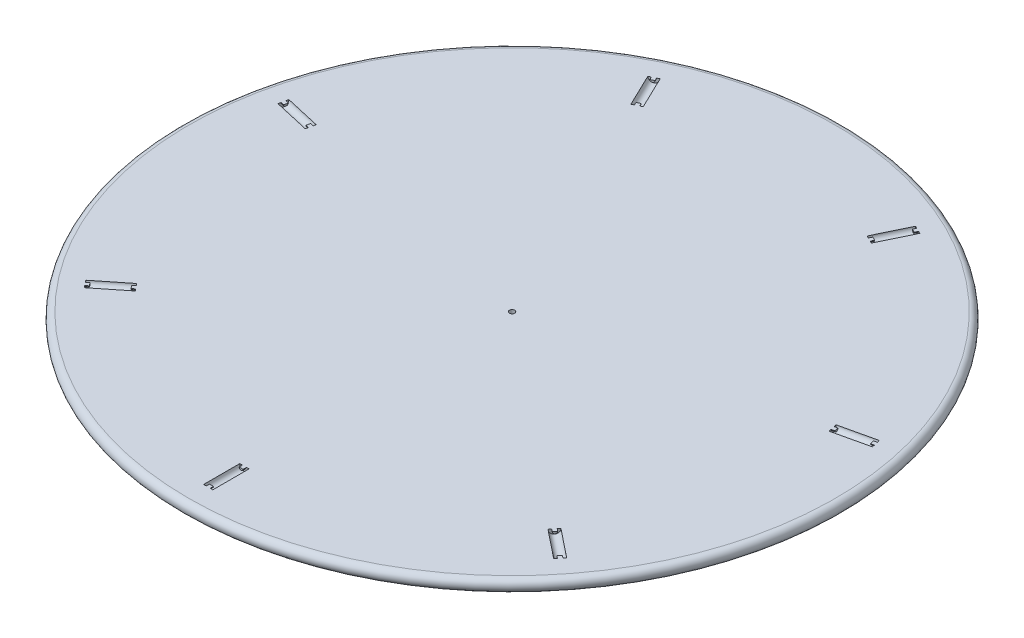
ISO-10303-21;
HEADER;
FILE_DESCRIPTION(('STEP AP214'),'2;1');
FILE_NAME('part.step','',(''),(''),'','','');
FILE_SCHEMA(('AUTOMOTIVE_DESIGN { 1 0 10303 214 1 1 1 1 }'));
ENDSEC;
DATA;
#1=APPLICATION_CONTEXT('core data for automotive mechanical design processes');
#2=APPLICATION_PROTOCOL_DEFINITION('international standard','automotive_design',2000,#1);
#3=PRODUCT_CONTEXT('',#1,'mechanical');
#4=PRODUCT('Part','Part','',(#3));
#5=PRODUCT_RELATED_PRODUCT_CATEGORY('part','',(#4));
#6=PRODUCT_DEFINITION_FORMATION('','',#4);
#7=PRODUCT_DEFINITION_CONTEXT('part definition',#1,'design');
#8=PRODUCT_DEFINITION('design','',#6,#7);
#9=PRODUCT_DEFINITION_SHAPE('','',#8);
#10=(LENGTH_UNIT() NAMED_UNIT(*) SI_UNIT(.MILLI.,.METRE.));
#11=(NAMED_UNIT(*) PLANE_ANGLE_UNIT() SI_UNIT($,.RADIAN.));
#12=(NAMED_UNIT(*) SI_UNIT($,.STERADIAN.) SOLID_ANGLE_UNIT());
#13=UNCERTAINTY_MEASURE_WITH_UNIT(LENGTH_MEASURE(1.E-05),#10,'distance_accuracy_value','');
#14=(GEOMETRIC_REPRESENTATION_CONTEXT(3) GLOBAL_UNCERTAINTY_ASSIGNED_CONTEXT((#13)) GLOBAL_UNIT_ASSIGNED_CONTEXT((#10,
#11,#12)) REPRESENTATION_CONTEXT('',''));
#15=CARTESIAN_POINT('',(0.,0.,0.));
#16=DIRECTION('',(0.,0.,1.));
#17=DIRECTION('',(1.,0.,0.));
#18=AXIS2_PLACEMENT_3D('',#15,#16,#17);
#19=CARTESIAN_POINT('',(0.,19.05,0.));
#20=DIRECTION('',(0.,1.,0.));
#21=DIRECTION('',(0.,0.,1.));
#22=AXIS2_PLACEMENT_3D('',#19,#20,#21);
#23=PLANE('',#22);
#24=CARTESIAN_POINT('',(0.,19.05,0.));
#25=DIRECTION('',(0.,1.,0.));
#26=DIRECTION('',(0.,0.,1.));
#27=AXIS2_PLACEMENT_3D('',#24,#25,#26);
#28=CIRCLE('',#27,4.);
#29=CARTESIAN_POINT('',(0.,19.05,4.));
#30=VERTEX_POINT('',#29);
#31=EDGE_CURVE('E615',#30,#30,#28,.T.);
#32=ORIENTED_EDGE('',*,*,#31,.F.);
#33=EDGE_LOOP('',(#32));
#34=FACE_BOUND('',#33,.T.);
#35=CARTESIAN_POINT('',(0.,19.05,0.));
#36=DIRECTION('',(0.,1.,0.));
#37=DIRECTION('',(0.,0.,1.));
#38=AXIS2_PLACEMENT_3D('',#35,#36,#37);
#39=CIRCLE('',#38,490.475);
#40=CARTESIAN_POINT('',(0.,19.05,490.475));
#41=VERTEX_POINT('',#40);
#42=EDGE_CURVE('E611',#41,#41,#39,.T.);
#43=ORIENTED_EDGE('',*,*,#42,.T.);
#44=EDGE_LOOP('',(#43));
#45=FACE_BOUND('',#44,.T.);
#46=DIRECTION('',(1.,0.,0.));
#47=VECTOR('',#46,1.);
#48=CARTESIAN_POINT('',(0.,19.05,411.));
#49=LINE('',#48,#47);
#50=CARTESIAN_POINT('',(-3.,19.05,411.));
#51=VERTEX_POINT('',#50);
#52=CARTESIAN_POINT('',(3.,19.05,411.));
#53=VERTEX_POINT('',#52);
#54=EDGE_CURVE('E583',#51,#53,#49,.T.);
#55=ORIENTED_EDGE('',*,*,#54,.T.);
#56=DIRECTION('',(0.,0.,-1.));
#57=VECTOR('',#56,1.);
#58=CARTESIAN_POINT('',(3.,19.05,411.));
#59=LINE('',#58,#57);
#60=CARTESIAN_POINT('',(3.,19.05,406.));
#61=VERTEX_POINT('',#60);
#62=EDGE_CURVE('E565',#53,#61,#59,.T.);
#63=ORIENTED_EDGE('',*,*,#62,.T.);
#64=DIRECTION('',(1.,0.,0.));
#65=VECTOR('',#64,1.);
#66=CARTESIAN_POINT('',(0.,19.05,406.));
#67=LINE('',#66,#65);
#68=CARTESIAN_POINT('',(7.00000000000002,19.05,406.));
#69=VERTEX_POINT('',#68);
#70=EDGE_CURVE('E569',#61,#69,#67,.T.);
#71=ORIENTED_EDGE('',*,*,#70,.T.);
#72=DIRECTION('',(0.,0.,-1.));
#73=VECTOR('',#72,1.);
#74=CARTESIAN_POINT('',(7.00000000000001,19.05,411.));
#75=LINE('',#74,#73);
#76=CARTESIAN_POINT('',(7.00000000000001,19.05,461.));
#77=VERTEX_POINT('',#76);
#78=EDGE_CURVE('E570',#69,#77,#75,.F.);
#79=ORIENTED_EDGE('',*,*,#78,.T.);
#80=DIRECTION('',(-1.,0.,0.));
#81=VECTOR('',#80,1.);
#82=CARTESIAN_POINT('',(0.,19.05,461.));
#83=LINE('',#82,#81);
#84=CARTESIAN_POINT('',(3.,19.05,461.));
#85=VERTEX_POINT('',#84);
#86=EDGE_CURVE('E574',#77,#85,#83,.T.);
#87=ORIENTED_EDGE('',*,*,#86,.T.);
#88=DIRECTION('',(0.,0.,-1.));
#89=VECTOR('',#88,1.);
#90=CARTESIAN_POINT('',(2.99999999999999,19.05,411.));
#91=LINE('',#90,#89);
#92=CARTESIAN_POINT('',(3.,19.05,456.));
#93=VERTEX_POINT('',#92);
#94=EDGE_CURVE('E575',#85,#93,#91,.T.);
#95=ORIENTED_EDGE('',*,*,#94,.T.);
#96=DIRECTION('',(-1.,0.,0.));
#97=VECTOR('',#96,1.);
#98=CARTESIAN_POINT('',(0.,19.05,456.));
#99=LINE('',#98,#97);
#100=CARTESIAN_POINT('',(-2.99999999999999,19.05,456.));
#101=VERTEX_POINT('',#100);
#102=EDGE_CURVE('E579',#93,#101,#99,.T.);
#103=ORIENTED_EDGE('',*,*,#102,.T.);
#104=DIRECTION('',(0.,0.,-1.));
#105=VECTOR('',#104,1.);
#106=CARTESIAN_POINT('',(-2.99999999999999,19.05,411.));
#107=LINE('',#106,#105);
#108=CARTESIAN_POINT('',(-2.99999999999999,19.05,461.));
#109=VERTEX_POINT('',#108);
#110=EDGE_CURVE('E603',#101,#109,#107,.F.);
#111=ORIENTED_EDGE('',*,*,#110,.T.);
#112=CARTESIAN_POINT('',(-6.99999999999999,19.05,461.));
#113=VERTEX_POINT('',#112);
#114=EDGE_CURVE('E599',#109,#113,#83,.T.);
#115=ORIENTED_EDGE('',*,*,#114,.T.);
#116=DIRECTION('',(0.,0.,-1.));
#117=VECTOR('',#116,1.);
#118=CARTESIAN_POINT('',(-7.00000000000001,19.05,411.));
#119=LINE('',#118,#117);
#120=CARTESIAN_POINT('',(-7.00000000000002,19.05,406.));
#121=VERTEX_POINT('',#120);
#122=EDGE_CURVE('E595',#113,#121,#119,.T.);
#123=ORIENTED_EDGE('',*,*,#122,.T.);
#124=CARTESIAN_POINT('',(-3.,19.05,406.));
#125=VERTEX_POINT('',#124);
#126=EDGE_CURVE('E591',#121,#125,#67,.T.);
#127=ORIENTED_EDGE('',*,*,#126,.T.);
#128=DIRECTION('',(0.,0.,-1.));
#129=VECTOR('',#128,1.);
#130=CARTESIAN_POINT('',(-3.,19.05,411.));
#131=LINE('',#130,#129);
#132=EDGE_CURVE('E587',#125,#51,#131,.F.);
#133=ORIENTED_EDGE('',*,*,#132,.T.);
#134=EDGE_LOOP('',(#55,#63,#71,#79,#87,#95,#103,#111,#115,#123,#127,#133));
#135=FACE_BOUND('',#134,.T.);
#136=DIRECTION('',(0.623489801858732,0.,-0.781831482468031));
#137=VECTOR('',#136,1.);
#138=CARTESIAN_POINT('',(321.332739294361,19.05,256.254308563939));
#139=LINE('',#138,#137);
#140=CARTESIAN_POINT('',(319.462269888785,19.05,258.599803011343));
#141=VERTEX_POINT('',#140);
#142=CARTESIAN_POINT('',(323.203208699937,19.05,253.908814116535));
#143=VERTEX_POINT('',#142);
#144=EDGE_CURVE('E541',#141,#143,#139,.T.);
#145=ORIENTED_EDGE('',*,*,#144,.T.);
#146=DIRECTION('',(-0.781831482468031,0.,-0.623489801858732));
#147=VECTOR('',#146,1.);
#148=CARTESIAN_POINT('',(323.203208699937,19.05,253.908814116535));
#149=LINE('',#148,#147);
#150=CARTESIAN_POINT('',(319.294051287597,19.05,250.791365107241));
#151=VERTEX_POINT('',#150);
#152=EDGE_CURVE('E523',#143,#151,#149,.T.);
#153=ORIENTED_EDGE('',*,*,#152,.T.);
#154=DIRECTION('',(0.623489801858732,0.,-0.781831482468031));
#155=VECTOR('',#154,1.);
#156=CARTESIAN_POINT('',(317.423581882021,19.05,253.136859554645));
#157=LINE('',#156,#155);
#158=CARTESIAN_POINT('',(321.788010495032,19.05,247.664039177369));
#159=VERTEX_POINT('',#158);
#160=EDGE_CURVE('E527',#151,#159,#157,.T.);
#161=ORIENTED_EDGE('',*,*,#160,.T.);
#162=DIRECTION('',(-0.781831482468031,0.,-0.623489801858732));
#163=VECTOR('',#162,1.);
#164=CARTESIAN_POINT('',(325.697167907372,19.05,250.781488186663));
#165=LINE('',#164,#163);
#166=CARTESIAN_POINT('',(364.788742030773,19.05,281.955978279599));
#167=VERTEX_POINT('',#166);
#168=EDGE_CURVE('E528',#159,#167,#165,.F.);
#169=ORIENTED_EDGE('',*,*,#168,.T.);
#170=DIRECTION('',(-0.623489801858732,0.,0.781831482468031));
#171=VECTOR('',#170,1.);
#172=CARTESIAN_POINT('',(360.424313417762,19.05,287.428798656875));
#173=LINE('',#172,#171);
#174=CARTESIAN_POINT('',(362.294782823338,19.05,285.083304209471));
#175=VERTEX_POINT('',#174);
#176=EDGE_CURVE('E532',#167,#175,#173,.T.);
#177=ORIENTED_EDGE('',*,*,#176,.T.);
#178=DIRECTION('',(-0.781831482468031,0.,-0.623489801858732));
#179=VECTOR('',#178,1.);
#180=CARTESIAN_POINT('',(323.203208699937,19.05,253.908814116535));
#181=LINE('',#180,#179);
#182=CARTESIAN_POINT('',(358.385625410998,19.05,281.965855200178));
#183=VERTEX_POINT('',#182);
#184=EDGE_CURVE('E533',#175,#183,#181,.T.);
#185=ORIENTED_EDGE('',*,*,#184,.T.);
#186=DIRECTION('',(-0.623489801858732,0.,0.781831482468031));
#187=VECTOR('',#186,1.);
#188=CARTESIAN_POINT('',(356.515156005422,19.05,284.311349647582));
#189=LINE('',#188,#187);
#190=CARTESIAN_POINT('',(354.644686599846,19.05,286.656844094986));
#191=VERTEX_POINT('',#190);
#192=EDGE_CURVE('E537',#183,#191,#189,.T.);
#193=ORIENTED_EDGE('',*,*,#192,.T.);
#194=DIRECTION('',(-0.781831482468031,0.,-0.623489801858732));
#195=VECTOR('',#194,1.);
#196=CARTESIAN_POINT('',(319.462269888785,19.05,258.599803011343));
#197=LINE('',#196,#195);
#198=CARTESIAN_POINT('',(358.553844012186,19.05,289.77429310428));
#199=VERTEX_POINT('',#198);
#200=EDGE_CURVE('E561',#191,#199,#197,.F.);
#201=ORIENTED_EDGE('',*,*,#200,.T.);
#202=CARTESIAN_POINT('',(356.059884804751,19.05,292.901619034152));
#203=VERTEX_POINT('',#202);
#204=EDGE_CURVE('E557',#199,#203,#173,.T.);
#205=ORIENTED_EDGE('',*,*,#204,.T.);
#206=DIRECTION('',(-0.781831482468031,0.,-0.623489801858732));
#207=VECTOR('',#206,1.);
#208=CARTESIAN_POINT('',(316.96831068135,19.05,261.727128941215));
#209=LINE('',#208,#207);
#210=CARTESIAN_POINT('',(313.05915326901,19.05,258.609679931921));
#211=VERTEX_POINT('',#210);
#212=EDGE_CURVE('E553',#203,#211,#209,.T.);
#213=ORIENTED_EDGE('',*,*,#212,.T.);
#214=CARTESIAN_POINT('',(315.553112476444,19.05,255.482354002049));
#215=VERTEX_POINT('',#214);
#216=EDGE_CURVE('E549',#211,#215,#157,.T.);
#217=ORIENTED_EDGE('',*,*,#216,.T.);
#218=DIRECTION('',(-0.781831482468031,0.,-0.623489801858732));
#219=VECTOR('',#218,1.);
#220=CARTESIAN_POINT('',(319.462269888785,19.05,258.599803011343));
#221=LINE('',#220,#219);
#222=EDGE_CURVE('E545',#215,#141,#221,.F.);
#223=ORIENTED_EDGE('',*,*,#222,.T.);
#224=EDGE_LOOP('',(#145,#153,#161,#169,#177,#185,#193,#201,#205,#213,#217,#223));
#225=FACE_BOUND('',#224,.T.);
#226=DIRECTION('',(-0.222520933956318,0.,-0.974927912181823));
#227=VECTOR('',#226,1.);
#228=CARTESIAN_POINT('',(400.695371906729,19.05,-91.4561038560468));
#229=LINE('',#228,#227);
#230=CARTESIAN_POINT('',(401.362934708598,19.05,-88.5313201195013));
#231=VERTEX_POINT('',#230);
#232=CARTESIAN_POINT('',(400.02780910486,19.05,-94.3808875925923));
#233=VERTEX_POINT('',#232);
#234=EDGE_CURVE('E499',#231,#233,#229,.T.);
#235=ORIENTED_EDGE('',*,*,#234,.T.);
#236=DIRECTION('',(-0.974927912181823,0.,0.222520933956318));
#237=VECTOR('',#236,1.);
#238=CARTESIAN_POINT('',(400.02780910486,19.05,-94.3808875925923));
#239=LINE('',#238,#237);
#240=CARTESIAN_POINT('',(395.153169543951,19.05,-93.2682829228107));
#241=VERTEX_POINT('',#240);
#242=EDGE_CURVE('E481',#233,#241,#239,.T.);
#243=ORIENTED_EDGE('',*,*,#242,.T.);
#244=DIRECTION('',(-0.222520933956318,0.,-0.974927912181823));
#245=VECTOR('',#244,1.);
#246=CARTESIAN_POINT('',(395.82073234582,19.05,-90.3434991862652));
#247=LINE('',#246,#245);
#248=CARTESIAN_POINT('',(394.263085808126,19.05,-97.167994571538));
#249=VERTEX_POINT('',#248);
#250=EDGE_CURVE('E485',#241,#249,#247,.T.);
#251=ORIENTED_EDGE('',*,*,#250,.T.);
#252=DIRECTION('',(-0.974927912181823,0.,0.222520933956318));
#253=VECTOR('',#252,1.);
#254=CARTESIAN_POINT('',(399.137725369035,19.05,-98.2805992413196));
#255=LINE('',#254,#253);
#256=CARTESIAN_POINT('',(447.884120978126,19.05,-109.406645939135));
#257=VERTEX_POINT('',#256);
#258=EDGE_CURVE('E486',#249,#257,#255,.F.);
#259=ORIENTED_EDGE('',*,*,#258,.T.);
#260=DIRECTION('',(0.222520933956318,0.,0.974927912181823));
#261=VECTOR('',#260,1.);
#262=CARTESIAN_POINT('',(449.44176751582,19.05,-102.582150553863));
#263=LINE('',#262,#261);
#264=CARTESIAN_POINT('',(448.774204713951,19.05,-105.506934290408));
#265=VERTEX_POINT('',#264);
#266=EDGE_CURVE('E490',#257,#265,#263,.T.);
#267=ORIENTED_EDGE('',*,*,#266,.T.);
#268=DIRECTION('',(-0.974927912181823,0.,0.222520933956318));
#269=VECTOR('',#268,1.);
#270=CARTESIAN_POINT('',(400.02780910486,19.05,-94.3808875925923));
#271=LINE('',#270,#269);
#272=CARTESIAN_POINT('',(443.899565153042,19.05,-104.394329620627));
#273=VERTEX_POINT('',#272);
#274=EDGE_CURVE('E491',#265,#273,#271,.T.);
#275=ORIENTED_EDGE('',*,*,#274,.T.);
#276=DIRECTION('',(0.222520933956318,0.,0.974927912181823));
#277=VECTOR('',#276,1.);
#278=CARTESIAN_POINT('',(444.567127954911,19.05,-101.469545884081));
#279=LINE('',#278,#277);
#280=CARTESIAN_POINT('',(445.23469075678,19.05,-98.5447621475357));
#281=VERTEX_POINT('',#280);
#282=EDGE_CURVE('E495',#273,#281,#279,.T.);
#283=ORIENTED_EDGE('',*,*,#282,.T.);
#284=DIRECTION('',(-0.974927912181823,0.,0.222520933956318));
#285=VECTOR('',#284,1.);
#286=CARTESIAN_POINT('',(401.362934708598,19.05,-88.5313201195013));
#287=LINE('',#286,#285);
#288=CARTESIAN_POINT('',(450.109330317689,19.05,-99.6573668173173));
#289=VERTEX_POINT('',#288);
#290=EDGE_CURVE('E519',#281,#289,#287,.F.);
#291=ORIENTED_EDGE('',*,*,#290,.T.);
#292=CARTESIAN_POINT('',(450.999414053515,19.05,-95.7576551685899));
#293=VERTEX_POINT('',#292);
#294=EDGE_CURVE('E515',#289,#293,#263,.T.);
#295=ORIENTED_EDGE('',*,*,#294,.T.);
#296=DIRECTION('',(-0.974927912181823,0.,0.222520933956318));
#297=VECTOR('',#296,1.);
#298=CARTESIAN_POINT('',(402.253018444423,19.05,-84.631608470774));
#299=LINE('',#298,#297);
#300=CARTESIAN_POINT('',(397.378378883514,19.05,-83.5190038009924));
#301=VERTEX_POINT('',#300);
#302=EDGE_CURVE('E511',#293,#301,#299,.T.);
#303=ORIENTED_EDGE('',*,*,#302,.T.);
#304=CARTESIAN_POINT('',(396.488295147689,19.05,-87.4187154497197));
#305=VERTEX_POINT('',#304);
#306=EDGE_CURVE('E507',#301,#305,#247,.T.);
#307=ORIENTED_EDGE('',*,*,#306,.T.);
#308=DIRECTION('',(-0.974927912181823,0.,0.222520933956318));
#309=VECTOR('',#308,1.);
#310=CARTESIAN_POINT('',(401.362934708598,19.05,-88.5313201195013));
#311=LINE('',#310,#309);
#312=EDGE_CURVE('E503',#305,#231,#311,.F.);
#313=ORIENTED_EDGE('',*,*,#312,.T.);
#314=EDGE_LOOP('',(#235,#243,#251,#259,#267,#275,#283,#291,#295,#303,#307,#313));
#315=FACE_BOUND('',#314,.T.);
#316=DIRECTION('',(-0.900968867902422,0.,-0.433883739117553));
#317=VECTOR('',#316,1.);
#318=CARTESIAN_POINT('',(178.326216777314,19.05,-370.298204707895));
#319=LINE('',#318,#317);
#320=CARTESIAN_POINT('',(181.029123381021,19.05,-368.996553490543));
#321=VERTEX_POINT('',#320);
#322=CARTESIAN_POINT('',(175.623310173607,19.05,-371.599855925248));
#323=VERTEX_POINT('',#322);
#324=EDGE_CURVE('E457',#321,#323,#319,.T.);
#325=ORIENTED_EDGE('',*,*,#324,.T.);
#326=DIRECTION('',(-0.433883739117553,0.,0.900968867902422));
#327=VECTOR('',#326,1.);
#328=CARTESIAN_POINT('',(175.623310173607,19.05,-371.599855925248));
#329=LINE('',#328,#327);
#330=CARTESIAN_POINT('',(173.453891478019,19.05,-367.095011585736));
#331=VERTEX_POINT('',#330);
#332=EDGE_CURVE('E439',#323,#331,#329,.T.);
#333=ORIENTED_EDGE('',*,*,#332,.T.);
#334=DIRECTION('',(-0.900968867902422,0.,-0.433883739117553));
#335=VECTOR('',#334,1.);
#336=CARTESIAN_POINT('',(176.156798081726,19.05,-365.793360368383));
#337=LINE('',#336,#335);
#338=CARTESIAN_POINT('',(169.850016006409,19.05,-368.830546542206));
#339=VERTEX_POINT('',#338);
#340=EDGE_CURVE('E443',#331,#339,#337,.T.);
#341=ORIENTED_EDGE('',*,*,#340,.T.);
#342=DIRECTION('',(-0.433883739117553,0.,0.900968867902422));
#343=VECTOR('',#342,1.);
#344=CARTESIAN_POINT('',(172.019434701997,19.05,-373.335390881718));
#345=LINE('',#344,#343);
#346=CARTESIAN_POINT('',(193.713621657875,19.05,-418.383834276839));
#347=VERTEX_POINT('',#346);
#348=EDGE_CURVE('E444',#339,#347,#345,.F.);
#349=ORIENTED_EDGE('',*,*,#348,.T.);
#350=DIRECTION('',(0.900968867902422,0.,0.433883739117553));
#351=VECTOR('',#350,1.);
#352=CARTESIAN_POINT('',(200.020403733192,19.05,-415.346648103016));
#353=LINE('',#352,#351);
#354=CARTESIAN_POINT('',(197.317497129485,19.05,-416.648299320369));
#355=VERTEX_POINT('',#354);
#356=EDGE_CURVE('E448',#347,#355,#353,.T.);
#357=ORIENTED_EDGE('',*,*,#356,.T.);
#358=DIRECTION('',(-0.433883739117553,0.,0.900968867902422));
#359=VECTOR('',#358,1.);
#360=CARTESIAN_POINT('',(175.623310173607,19.05,-371.599855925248));
#361=LINE('',#360,#359);
#362=CARTESIAN_POINT('',(195.148078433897,19.05,-412.143454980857));
#363=VERTEX_POINT('',#362);
#364=EDGE_CURVE('E449',#355,#363,#361,.T.);
#365=ORIENTED_EDGE('',*,*,#364,.T.);
#366=DIRECTION('',(0.900968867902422,0.,0.433883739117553));
#367=VECTOR('',#366,1.);
#368=CARTESIAN_POINT('',(197.850985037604,19.05,-410.841803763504));
#369=LINE('',#368,#367);
#370=CARTESIAN_POINT('',(200.553891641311,19.05,-409.540152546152));
#371=VERTEX_POINT('',#370);
#372=EDGE_CURVE('E453',#363,#371,#369,.T.);
#373=ORIENTED_EDGE('',*,*,#372,.T.);
#374=DIRECTION('',(-0.433883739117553,0.,0.900968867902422));
#375=VECTOR('',#374,1.);
#376=CARTESIAN_POINT('',(181.029123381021,19.05,-368.996553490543));
#377=LINE('',#376,#375);
#378=CARTESIAN_POINT('',(202.723310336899,19.05,-414.044996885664));
#379=VERTEX_POINT('',#378);
#380=EDGE_CURVE('E477',#371,#379,#377,.F.);
#381=ORIENTED_EDGE('',*,*,#380,.T.);
#382=CARTESIAN_POINT('',(206.327185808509,19.05,-412.309461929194));
#383=VERTEX_POINT('',#382);
#384=EDGE_CURVE('E473',#379,#383,#353,.T.);
#385=ORIENTED_EDGE('',*,*,#384,.T.);
#386=DIRECTION('',(-0.433883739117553,0.,0.900968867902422));
#387=VECTOR('',#386,1.);
#388=CARTESIAN_POINT('',(184.632998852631,19.05,-367.261018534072));
#389=LINE('',#388,#387);
#390=CARTESIAN_POINT('',(182.463580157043,19.05,-362.75617419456));
#391=VERTEX_POINT('',#390);
#392=EDGE_CURVE('E469',#383,#391,#389,.T.);
#393=ORIENTED_EDGE('',*,*,#392,.T.);
#394=CARTESIAN_POINT('',(178.859704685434,19.05,-364.491709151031));
#395=VERTEX_POINT('',#394);
#396=EDGE_CURVE('E465',#391,#395,#337,.T.);
#397=ORIENTED_EDGE('',*,*,#396,.T.);
#398=DIRECTION('',(-0.433883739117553,0.,0.900968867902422));
#399=VECTOR('',#398,1.);
#400=CARTESIAN_POINT('',(181.029123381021,19.05,-368.996553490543));
#401=LINE('',#400,#399);
#402=EDGE_CURVE('E461',#395,#321,#401,.F.);
#403=ORIENTED_EDGE('',*,*,#402,.T.);
#404=EDGE_LOOP('',(#325,#333,#341,#349,#357,#365,#373,#381,#385,#393,#397,#403));
#405=FACE_BOUND('',#404,.T.);
#406=DIRECTION('',(-0.900968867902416,0.,0.433883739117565));
#407=VECTOR('',#406,1.);
#408=CARTESIAN_POINT('',(-178.326216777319,19.05,-370.298204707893));
#409=LINE('',#408,#407);
#410=CARTESIAN_POINT('',(-175.623310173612,19.05,-371.599855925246));
#411=VERTEX_POINT('',#410);
#412=CARTESIAN_POINT('',(-181.029123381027,19.05,-368.99655349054));
#413=VERTEX_POINT('',#412);
#414=EDGE_CURVE('E415',#411,#413,#409,.T.);
#415=ORIENTED_EDGE('',*,*,#414,.T.);
#416=DIRECTION('',(0.433883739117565,0.,0.900968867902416));
#417=VECTOR('',#416,1.);
#418=CARTESIAN_POINT('',(-181.029123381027,19.05,-368.99655349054));
#419=LINE('',#418,#417);
#420=CARTESIAN_POINT('',(-178.859704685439,19.05,-364.491709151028));
#421=VERTEX_POINT('',#420);
#422=EDGE_CURVE('E397',#413,#421,#419,.T.);
#423=ORIENTED_EDGE('',*,*,#422,.T.);
#424=DIRECTION('',(-0.900968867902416,0.,0.433883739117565));
#425=VECTOR('',#424,1.);
#426=CARTESIAN_POINT('',(-176.156798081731,19.05,-365.793360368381));
#427=LINE('',#426,#425);
#428=CARTESIAN_POINT('',(-182.463580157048,19.05,-362.756174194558));
#429=VERTEX_POINT('',#428);
#430=EDGE_CURVE('E401',#421,#429,#427,.T.);
#431=ORIENTED_EDGE('',*,*,#430,.T.);
#432=DIRECTION('',(0.433883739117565,0.,0.900968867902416));
#433=VECTOR('',#432,1.);
#434=CARTESIAN_POINT('',(-184.632998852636,19.05,-367.26101853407));
#435=LINE('',#434,#433);
#436=CARTESIAN_POINT('',(-206.327185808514,19.05,-412.309461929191));
#437=VERTEX_POINT('',#436);
#438=EDGE_CURVE('E402',#429,#437,#435,.F.);
#439=ORIENTED_EDGE('',*,*,#438,.T.);
#440=DIRECTION('',(0.900968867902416,0.,-0.433883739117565));
#441=VECTOR('',#440,1.);
#442=CARTESIAN_POINT('',(-200.020403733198,19.05,-415.346648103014));
#443=LINE('',#442,#441);
#444=CARTESIAN_POINT('',(-202.723310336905,19.05,-414.044996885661));
#445=VERTEX_POINT('',#444);
#446=EDGE_CURVE('E406',#437,#445,#443,.T.);
#447=ORIENTED_EDGE('',*,*,#446,.T.);
#448=DIRECTION('',(0.433883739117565,0.,0.900968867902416));
#449=VECTOR('',#448,1.);
#450=CARTESIAN_POINT('',(-181.029123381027,19.05,-368.99655349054));
#451=LINE('',#450,#449);
#452=CARTESIAN_POINT('',(-200.553891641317,19.05,-409.540152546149));
#453=VERTEX_POINT('',#452);
#454=EDGE_CURVE('E407',#445,#453,#451,.T.);
#455=ORIENTED_EDGE('',*,*,#454,.T.);
#456=DIRECTION('',(0.900968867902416,0.,-0.433883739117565));
#457=VECTOR('',#456,1.);
#458=CARTESIAN_POINT('',(-197.85098503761,19.05,-410.841803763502));
#459=LINE('',#458,#457);
#460=CARTESIAN_POINT('',(-195.148078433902,19.05,-412.143454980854));
#461=VERTEX_POINT('',#460);
#462=EDGE_CURVE('E411',#453,#461,#459,.T.);
#463=ORIENTED_EDGE('',*,*,#462,.T.);
#464=DIRECTION('',(0.433883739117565,0.,0.900968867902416));
#465=VECTOR('',#464,1.);
#466=CARTESIAN_POINT('',(-175.623310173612,19.05,-371.599855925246));
#467=LINE('',#466,#465);
#468=CARTESIAN_POINT('',(-197.31749712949,19.05,-416.648299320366));
#469=VERTEX_POINT('',#468);
#470=EDGE_CURVE('E435',#461,#469,#467,.F.);
#471=ORIENTED_EDGE('',*,*,#470,.T.);
#472=CARTESIAN_POINT('',(-193.713621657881,19.05,-418.383834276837));
#473=VERTEX_POINT('',#472);
#474=EDGE_CURVE('E431',#469,#473,#443,.T.);
#475=ORIENTED_EDGE('',*,*,#474,.T.);
#476=DIRECTION('',(0.433883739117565,0.,0.900968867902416));
#477=VECTOR('',#476,1.);
#478=CARTESIAN_POINT('',(-172.019434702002,19.05,-373.335390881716));
#479=LINE('',#478,#477);
#480=CARTESIAN_POINT('',(-169.850016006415,19.05,-368.830546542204));
#481=VERTEX_POINT('',#480);
#482=EDGE_CURVE('E427',#473,#481,#479,.T.);
#483=ORIENTED_EDGE('',*,*,#482,.T.);
#484=CARTESIAN_POINT('',(-173.453891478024,19.05,-367.095011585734));
#485=VERTEX_POINT('',#484);
#486=EDGE_CURVE('E423',#481,#485,#427,.T.);
#487=ORIENTED_EDGE('',*,*,#486,.T.);
#488=DIRECTION('',(0.433883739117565,0.,0.900968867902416));
#489=VECTOR('',#488,1.);
#490=CARTESIAN_POINT('',(-175.623310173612,19.05,-371.599855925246));
#491=LINE('',#490,#489);
#492=EDGE_CURVE('E419',#485,#411,#491,.F.);
#493=ORIENTED_EDGE('',*,*,#492,.T.);
#494=EDGE_LOOP('',(#415,#423,#431,#439,#447,#455,#463,#471,#475,#483,#487,#493));
#495=FACE_BOUND('',#494,.T.);
#496=DIRECTION('',(-0.222520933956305,0.,0.974927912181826));
#497=VECTOR('',#496,1.);
#498=CARTESIAN_POINT('',(-400.69537190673,19.05,-91.4561038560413));
#499=LINE('',#498,#497);
#500=CARTESIAN_POINT('',(-400.027809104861,19.05,-94.3808875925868));
#501=VERTEX_POINT('',#500);
#502=CARTESIAN_POINT('',(-401.362934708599,19.05,-88.5313201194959));
#503=VERTEX_POINT('',#502);
#504=EDGE_CURVE('E373',#501,#503,#499,.T.);
#505=ORIENTED_EDGE('',*,*,#504,.T.);
#506=DIRECTION('',(0.974927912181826,0.,0.222520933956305));
#507=VECTOR('',#506,1.);
#508=CARTESIAN_POINT('',(-401.362934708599,19.05,-88.5313201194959));
#509=LINE('',#508,#507);
#510=CARTESIAN_POINT('',(-396.48829514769,19.05,-87.4187154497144));
#511=VERTEX_POINT('',#510);
#512=EDGE_CURVE('E354',#503,#511,#509,.T.);
#513=ORIENTED_EDGE('',*,*,#512,.T.);
#514=DIRECTION('',(-0.222520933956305,0.,0.974927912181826));
#515=VECTOR('',#514,1.);
#516=CARTESIAN_POINT('',(-395.820732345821,19.05,-90.3434991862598));
#517=LINE('',#516,#515);
#518=CARTESIAN_POINT('',(-397.378378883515,19.05,-83.5190038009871));
#519=VERTEX_POINT('',#518);
#520=EDGE_CURVE('E357',#511,#519,#517,.T.);
#521=ORIENTED_EDGE('',*,*,#520,.T.);
#522=DIRECTION('',(0.974927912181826,0.,0.222520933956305));
#523=VECTOR('',#522,1.);
#524=CARTESIAN_POINT('',(-402.253018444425,19.05,-84.6316084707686));
#525=LINE('',#524,#523);
#526=CARTESIAN_POINT('',(-450.999414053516,19.05,-95.7576551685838));
#527=VERTEX_POINT('',#526);
#528=EDGE_CURVE('E360',#519,#527,#525,.F.);
#529=ORIENTED_EDGE('',*,*,#528,.T.);
#530=DIRECTION('',(0.222520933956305,0.,-0.974927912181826));
#531=VECTOR('',#530,1.);
#532=CARTESIAN_POINT('',(-449.441767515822,19.05,-102.582150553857));
#533=LINE('',#532,#531);
#534=CARTESIAN_POINT('',(-450.109330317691,19.05,-99.6573668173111));
#535=VERTEX_POINT('',#534);
#536=EDGE_CURVE('E364',#527,#535,#533,.T.);
#537=ORIENTED_EDGE('',*,*,#536,.T.);
#538=DIRECTION('',(0.974927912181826,0.,0.222520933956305));
#539=VECTOR('',#538,1.);
#540=CARTESIAN_POINT('',(-401.362934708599,19.05,-88.5313201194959));
#541=LINE('',#540,#539);
#542=CARTESIAN_POINT('',(-445.234690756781,19.05,-98.5447621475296));
#543=VERTEX_POINT('',#542);
#544=EDGE_CURVE('E365',#535,#543,#541,.T.);
#545=ORIENTED_EDGE('',*,*,#544,.T.);
#546=DIRECTION('',(0.222520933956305,0.,-0.974927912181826));
#547=VECTOR('',#546,1.);
#548=CARTESIAN_POINT('',(-444.567127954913,19.05,-101.469545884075));
#549=LINE('',#548,#547);
#550=CARTESIAN_POINT('',(-443.899565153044,19.05,-104.394329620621));
#551=VERTEX_POINT('',#550);
#552=EDGE_CURVE('E369',#543,#551,#549,.T.);
#553=ORIENTED_EDGE('',*,*,#552,.T.);
#554=DIRECTION('',(0.974927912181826,0.,0.222520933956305));
#555=VECTOR('',#554,1.);
#556=CARTESIAN_POINT('',(-400.027809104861,19.05,-94.3808875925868));
#557=LINE('',#556,#555);
#558=CARTESIAN_POINT('',(-448.774204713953,19.05,-105.506934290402));
#559=VERTEX_POINT('',#558);
#560=EDGE_CURVE('E393',#551,#559,#557,.F.);
#561=ORIENTED_EDGE('',*,*,#560,.T.);
#562=CARTESIAN_POINT('',(-447.884120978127,19.05,-109.406645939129));
#563=VERTEX_POINT('',#562);
#564=EDGE_CURVE('E389',#559,#563,#533,.T.);
#565=ORIENTED_EDGE('',*,*,#564,.T.);
#566=DIRECTION('',(0.974927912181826,0.,0.222520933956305));
#567=VECTOR('',#566,1.);
#568=CARTESIAN_POINT('',(-399.137725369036,19.05,-98.2805992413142));
#569=LINE('',#568,#567);
#570=CARTESIAN_POINT('',(-394.263085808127,19.05,-97.1679945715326));
#571=VERTEX_POINT('',#570);
#572=EDGE_CURVE('E385',#563,#571,#569,.T.);
#573=ORIENTED_EDGE('',*,*,#572,.T.);
#574=CARTESIAN_POINT('',(-395.153169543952,19.05,-93.2682829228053));
#575=VERTEX_POINT('',#574);
#576=EDGE_CURVE('E381',#571,#575,#517,.T.);
#577=ORIENTED_EDGE('',*,*,#576,.T.);
#578=DIRECTION('',(0.974927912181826,0.,0.222520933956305));
#579=VECTOR('',#578,1.);
#580=CARTESIAN_POINT('',(-400.027809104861,19.05,-94.3808875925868));
#581=LINE('',#580,#579);
#582=EDGE_CURVE('E377',#575,#501,#581,.F.);
#583=ORIENTED_EDGE('',*,*,#582,.T.);
#584=EDGE_LOOP('',(#505,#513,#521,#529,#537,#545,#553,#561,#565,#573,#577,#583));
#585=FACE_BOUND('',#584,.T.);
#586=DIRECTION('',(0.623489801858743,0.,0.781831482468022));
#587=VECTOR('',#586,1.);
#588=CARTESIAN_POINT('',(-321.332739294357,19.05,256.254308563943));
#589=LINE('',#588,#587);
#590=CARTESIAN_POINT('',(-323.203208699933,19.05,253.908814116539));
#591=VERTEX_POINT('',#590);
#592=CARTESIAN_POINT('',(-319.462269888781,19.05,258.599803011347));
#593=VERTEX_POINT('',#592);
#594=EDGE_CURVE('E778',#591,#593,#589,.T.);
#595=ORIENTED_EDGE('',*,*,#594,.T.);
#596=DIRECTION('',(0.781831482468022,0.,-0.623489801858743));
#597=VECTOR('',#596,1.);
#598=CARTESIAN_POINT('',(-319.462269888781,19.05,258.599803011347));
#599=LINE('',#598,#597);
#600=CARTESIAN_POINT('',(-315.553112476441,19.05,255.482354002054));
#601=VERTEX_POINT('',#600);
#602=EDGE_CURVE('E11',#593,#601,#599,.T.);
#603=ORIENTED_EDGE('',*,*,#602,.T.);
#604=DIRECTION('',(0.623489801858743,0.,0.781831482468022));
#605=VECTOR('',#604,1.);
#606=CARTESIAN_POINT('',(-317.423581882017,19.05,253.13685955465));
#607=LINE('',#606,#605);
#608=CARTESIAN_POINT('',(-313.059153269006,19.05,258.609679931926));
#609=VERTEX_POINT('',#608);
#610=EDGE_CURVE('E57',#601,#609,#607,.T.);
#611=ORIENTED_EDGE('',*,*,#610,.T.);
#612=DIRECTION('',(0.781831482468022,0.,-0.623489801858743));
#613=VECTOR('',#612,1.);
#614=CARTESIAN_POINT('',(-316.968310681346,19.05,261.72712894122));
#615=LINE('',#614,#613);
#616=CARTESIAN_POINT('',(-356.059884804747,19.05,292.901619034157));
#617=VERTEX_POINT('',#616);
#618=EDGE_CURVE('E341',#609,#617,#615,.F.);
#619=ORIENTED_EDGE('',*,*,#618,.T.);
#620=DIRECTION('',(-0.623489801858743,0.,-0.781831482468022));
#621=VECTOR('',#620,1.);
#622=CARTESIAN_POINT('',(-360.424313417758,19.05,287.428798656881));
#623=LINE('',#622,#621);
#624=CARTESIAN_POINT('',(-358.553844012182,19.05,289.774293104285));
#625=VERTEX_POINT('',#624);
#626=EDGE_CURVE('E325',#617,#625,#623,.T.);
#627=ORIENTED_EDGE('',*,*,#626,.T.);
#628=DIRECTION('',(0.781831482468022,0.,-0.623489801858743));
#629=VECTOR('',#628,1.);
#630=CARTESIAN_POINT('',(-319.462269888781,19.05,258.599803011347));
#631=LINE('',#630,#629);
#632=CARTESIAN_POINT('',(-354.644686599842,19.05,286.656844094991));
#633=VERTEX_POINT('',#632);
#634=EDGE_CURVE('E317',#625,#633,#631,.T.);
#635=ORIENTED_EDGE('',*,*,#634,.T.);
#636=DIRECTION('',(-0.623489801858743,0.,-0.781831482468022));
#637=VECTOR('',#636,1.);
#638=CARTESIAN_POINT('',(-356.515156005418,19.05,284.311349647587));
#639=LINE('',#638,#637);
#640=CARTESIAN_POINT('',(-358.385625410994,19.05,281.965855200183));
#641=VERTEX_POINT('',#640);
#642=EDGE_CURVE('E326',#633,#641,#639,.T.);
#643=ORIENTED_EDGE('',*,*,#642,.T.);
#644=DIRECTION('',(0.781831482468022,0.,-0.623489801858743));
#645=VECTOR('',#644,1.);
#646=CARTESIAN_POINT('',(-323.203208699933,19.05,253.908814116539));
#647=LINE('',#646,#645);
#648=CARTESIAN_POINT('',(-362.294782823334,19.05,285.083304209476));
#649=VERTEX_POINT('',#648);
#650=EDGE_CURVE('E349',#641,#649,#647,.F.);
#651=ORIENTED_EDGE('',*,*,#650,.T.);
#652=CARTESIAN_POINT('',(-364.788742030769,19.05,281.955978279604));
#653=VERTEX_POINT('',#652);
#654=EDGE_CURVE('E333',#649,#653,#623,.T.);
#655=ORIENTED_EDGE('',*,*,#654,.T.);
#656=DIRECTION('',(0.781831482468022,0.,-0.623489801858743));
#657=VECTOR('',#656,1.);
#658=CARTESIAN_POINT('',(-325.697167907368,19.05,250.781488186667));
#659=LINE('',#658,#657);
#660=CARTESIAN_POINT('',(-321.788010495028,19.05,247.664039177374));
#661=VERTEX_POINT('',#660);
#662=EDGE_CURVE('E348',#653,#661,#659,.T.);
#663=ORIENTED_EDGE('',*,*,#662,.T.);
#664=CARTESIAN_POINT('',(-319.294051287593,19.05,250.791365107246));
#665=VERTEX_POINT('',#664);
#666=EDGE_CURVE('E353',#661,#665,#607,.T.);
#667=ORIENTED_EDGE('',*,*,#666,.T.);
#668=DIRECTION('',(0.781831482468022,0.,-0.623489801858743));
#669=VECTOR('',#668,1.);
#670=CARTESIAN_POINT('',(-323.203208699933,19.05,253.908814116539));
#671=LINE('',#670,#669);
#672=EDGE_CURVE('E781',#665,#591,#671,.F.);
#673=ORIENTED_EDGE('',*,*,#672,.T.);
#674=EDGE_LOOP('',(#595,#603,#611,#619,#627,#635,#643,#651,#655,#663,#667,#673));
#675=FACE_BOUND('',#674,.T.);
#676=ADVANCED_FACE('F47',(#34,#45,#135,#225,#315,#405,#495,#585,#675),#23,.T.);
#677=CARTESIAN_POINT('',(0.,9.525,0.));
#678=DIRECTION('',(0.,1.,0.));
#679=DIRECTION('',(0.,0.,1.));
#680=AXIS2_PLACEMENT_3D('',#677,#678,#679);
#681=TOROIDAL_SURFACE('',#680,490.475,9.525);
#682=ORIENTED_EDGE('',*,*,#42,.F.);
#683=EDGE_LOOP('',(#682));
#684=FACE_BOUND('',#683,.T.);
#685=CARTESIAN_POINT('',(0.,0.,0.));
#686=DIRECTION('',(0.,1.,0.));
#687=DIRECTION('',(0.,0.,1.));
#688=AXIS2_PLACEMENT_3D('',#685,#686,#687);
#689=CIRCLE('',#688,490.475);
#690=CARTESIAN_POINT('',(0.,0.,490.475));
#691=VERTEX_POINT('',#690);
#692=EDGE_CURVE('E607',#691,#691,#689,.F.);
#693=ORIENTED_EDGE('',*,*,#692,.F.);
#694=EDGE_LOOP('',(#693));
#695=FACE_BOUND('',#694,.T.);
#696=ADVANCED_FACE('F50',(#684,#695),#681,.T.);
#697=CARTESIAN_POINT('',(0.,0.,0.));
#698=DIRECTION('',(0.,1.,0.));
#699=DIRECTION('',(0.,0.,1.));
#700=AXIS2_PLACEMENT_3D('',#697,#698,#699);
#701=PLANE('',#700);
#702=CARTESIAN_POINT('',(0.,0.,0.));
#703=DIRECTION('',(0.,1.,0.));
#704=DIRECTION('',(0.,0.,1.));
#705=AXIS2_PLACEMENT_3D('',#702,#703,#704);
#706=CIRCLE('',#705,4.);
#707=CARTESIAN_POINT('',(0.,0.,4.));
#708=VERTEX_POINT('',#707);
#709=EDGE_CURVE('E619',#708,#708,#706,.T.);
#710=ORIENTED_EDGE('',*,*,#709,.T.);
#711=EDGE_LOOP('',(#710));
#712=FACE_BOUND('',#711,.T.);
#713=ORIENTED_EDGE('',*,*,#692,.T.);
#714=EDGE_LOOP('',(#713));
#715=FACE_BOUND('',#714,.T.);
#716=ADVANCED_FACE('F816',(#712,#715),#701,.F.);
#717=CARTESIAN_POINT('',(0.,0.,0.));
#718=DIRECTION('',(0.,1.,0.));
#719=DIRECTION('',(0.,0.,1.));
#720=AXIS2_PLACEMENT_3D('',#717,#718,#719);
#721=CYLINDRICAL_SURFACE('',#720,4.);
#722=CARTESIAN_POINT('',(0.,19.05,4.));
#723=CARTESIAN_POINT('',(0.,18.8515625,4.));
#724=CARTESIAN_POINT('',(0.,18.653125,4.));
#725=CARTESIAN_POINT('',(0.,18.25625,4.));
#726=CARTESIAN_POINT('',(0.,18.0578125,4.));
#727=CARTESIAN_POINT('',(0.,17.6609375,4.));
#728=CARTESIAN_POINT('',(0.,17.4625,4.));
#729=CARTESIAN_POINT('',(0.,17.065625,4.));
#730=CARTESIAN_POINT('',(0.,16.8671875,4.));
#731=CARTESIAN_POINT('',(0.,16.4703125,4.));
#732=CARTESIAN_POINT('',(0.,16.271875,4.));
#733=CARTESIAN_POINT('',(0.,15.875,4.));
#734=CARTESIAN_POINT('',(0.,15.6765625,4.));
#735=CARTESIAN_POINT('',(0.,15.2796875,4.));
#736=CARTESIAN_POINT('',(0.,15.08125,4.));
#737=CARTESIAN_POINT('',(0.,14.684375,4.));
#738=CARTESIAN_POINT('',(0.,14.4859375,4.));
#739=CARTESIAN_POINT('',(0.,14.0890625,4.));
#740=CARTESIAN_POINT('',(0.,13.890625,4.));
#741=CARTESIAN_POINT('',(0.,13.49375,4.));
#742=CARTESIAN_POINT('',(0.,13.2953125,4.));
#743=CARTESIAN_POINT('',(0.,12.8984375,4.));
#744=CARTESIAN_POINT('',(0.,12.7,4.));
#745=CARTESIAN_POINT('',(0.,12.303125,4.));
#746=CARTESIAN_POINT('',(0.,12.1046875,4.));
#747=CARTESIAN_POINT('',(0.,11.7078125,4.));
#748=CARTESIAN_POINT('',(0.,11.509375,4.));
#749=CARTESIAN_POINT('',(0.,11.1125,4.));
#750=CARTESIAN_POINT('',(0.,10.9140625,4.));
#751=CARTESIAN_POINT('',(0.,10.5171875,4.));
#752=CARTESIAN_POINT('',(0.,10.31875,4.));
#753=CARTESIAN_POINT('',(0.,9.921875,4.));
#754=CARTESIAN_POINT('',(0.,9.7234375,4.));
#755=CARTESIAN_POINT('',(0.,9.3265625,4.));
#756=CARTESIAN_POINT('',(0.,9.128125,4.));
#757=CARTESIAN_POINT('',(0.,8.73125,4.));
#758=CARTESIAN_POINT('',(0.,8.5328125,4.));
#759=CARTESIAN_POINT('',(0.,8.1359375,4.));
#760=CARTESIAN_POINT('',(0.,7.9375,4.));
#761=CARTESIAN_POINT('',(0.,7.540625,4.));
#762=CARTESIAN_POINT('',(0.,7.3421875,4.));
#763=CARTESIAN_POINT('',(0.,6.9453125,4.));
#764=CARTESIAN_POINT('',(0.,6.746875,4.));
#765=CARTESIAN_POINT('',(0.,6.35,4.));
#766=CARTESIAN_POINT('',(0.,6.1515625,4.));
#767=CARTESIAN_POINT('',(0.,5.7546875,4.));
#768=CARTESIAN_POINT('',(0.,5.55625,4.));
#769=CARTESIAN_POINT('',(0.,5.159375,4.));
#770=CARTESIAN_POINT('',(0.,4.9609375,4.));
#771=CARTESIAN_POINT('',(0.,4.5640625,4.));
#772=CARTESIAN_POINT('',(0.,4.365625,4.));
#773=CARTESIAN_POINT('',(0.,3.96875,4.));
#774=CARTESIAN_POINT('',(0.,3.7703125,4.));
#775=CARTESIAN_POINT('',(0.,3.3734375,4.));
#776=CARTESIAN_POINT('',(0.,3.175,4.));
#777=CARTESIAN_POINT('',(0.,2.778125,4.));
#778=CARTESIAN_POINT('',(0.,2.5796875,4.));
#779=CARTESIAN_POINT('',(0.,2.1828125,4.));
#780=CARTESIAN_POINT('',(0.,1.984375,4.));
#781=CARTESIAN_POINT('',(0.,1.5875,4.));
#782=CARTESIAN_POINT('',(0.,1.3890625,4.));
#783=CARTESIAN_POINT('',(0.,0.9921875,4.));
#784=CARTESIAN_POINT('',(0.,0.79375,4.));
#785=CARTESIAN_POINT('',(0.,0.396875,4.));
#786=CARTESIAN_POINT('',(0.,0.1984375,4.));
#787=CARTESIAN_POINT('',(0.,0.,4.));
#788=B_SPLINE_CURVE_WITH_KNOTS('',3,(#722,#723,#724,#725,#726,#727,#728,#729,#730,#731,#732,
#733,#734,#735,#736,#737,#738,#739,#740,#741,#742,#743,#744,#745,#746,#747,#748,#749,#750,#751,
#752,#753,#754,#755,#756,#757,#758,#759,#760,#761,#762,#763,#764,#765,#766,#767,#768,#769,#770,
#771,#772,#773,#774,#775,#776,#777,#778,#779,#780,#781,#782,#783,#784,#785,#786,#787),
.UNSPECIFIED.,.F.,.F.,(4,2,2,2,2,2,2,2,2,2,2,2,2,2,2,2,2,2,2,2,2,2,2,2,2,2,2,2,2,2,2,2,4),(0.,
0.5953125,1.190625,1.7859375,2.38125,2.9765625,3.571875,4.1671875,4.7625,5.3578125,5.953125,
6.5484375,7.14375,7.7390625,8.334375,8.9296875,9.525,10.1203125,10.715625,11.3109375,11.90625,
12.5015625,13.096875,13.6921875,14.2875,14.8828125,15.478125,16.0734375,16.66875,17.2640625,
17.859375,18.4546875,19.05),.UNSPECIFIED.);
#789=EDGE_CURVE('BSEAM821',#30,#708,#788,.T.);
#790=ORIENTED_EDGE('',*,*,#31,.T.);
#791=ORIENTED_EDGE('',*,*,#709,.F.);
#792=ORIENTED_EDGE('',*,*,#789,.T.);
#793=ORIENTED_EDGE('',*,*,#789,.F.);
#794=EDGE_LOOP('',(#790,#792,#791,#793));
#795=FACE_BOUND('',#794,.T.);
#796=ADVANCED_FACE('F821',(#795),#721,.F.);
#797=CARTESIAN_POINT('',(0.,19.05,456.));
#798=DIRECTION('',(0.,0.,-1.));
#799=DIRECTION('',(-1.,0.,0.));
#800=AXIS2_PLACEMENT_3D('',#797,#798,#799);
#801=PLANE('',#800);
#802=CARTESIAN_POINT('',(0.,19.05,456.));
#803=DIRECTION('',(0.,0.,-1.));
#804=DIRECTION('',(-1.,0.,0.));
#805=AXIS2_PLACEMENT_3D('',#802,#803,#804);
#806=CIRCLE('',#805,2.99999999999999);
#807=EDGE_CURVE('E642',#93,#101,#806,.T.);
#808=ORIENTED_EDGE('',*,*,#807,.T.);
#809=ORIENTED_EDGE('',*,*,#102,.F.);
#810=EDGE_LOOP('',(#808,#809));
#811=FACE_BOUND('',#810,.T.);
#812=ADVANCED_FACE('F828',(#811),#801,.T.);
#813=CARTESIAN_POINT('',(0.,19.05,411.));
#814=DIRECTION('',(0.,0.,1.));
#815=DIRECTION('',(1.,0.,0.));
#816=AXIS2_PLACEMENT_3D('',#813,#814,#815);
#817=PLANE('',#816);
#818=CARTESIAN_POINT('',(0.,19.05,411.));
#819=DIRECTION('',(0.,0.,-1.));
#820=DIRECTION('',(-1.,0.,0.));
#821=AXIS2_PLACEMENT_3D('',#818,#819,#820);
#822=CIRCLE('',#821,3.);
#823=EDGE_CURVE('E623',#53,#51,#822,.T.);
#824=ORIENTED_EDGE('',*,*,#823,.F.);
#825=ORIENTED_EDGE('',*,*,#54,.F.);
#826=EDGE_LOOP('',(#824,#825));
#827=FACE_BOUND('',#826,.T.);
#828=ADVANCED_FACE('F838',(#827),#817,.T.);
#829=CARTESIAN_POINT('',(0.,19.05,411.));
#830=DIRECTION('',(0.,0.,-1.));
#831=DIRECTION('',(-1.,0.,0.));
#832=AXIS2_PLACEMENT_3D('',#829,#830,#831);
#833=CYLINDRICAL_SURFACE('',#832,3.);
#834=ORIENTED_EDGE('',*,*,#823,.T.);
#835=ORIENTED_EDGE('',*,*,#132,.F.);
#836=CARTESIAN_POINT('',(0.,19.05,406.));
#837=DIRECTION('',(0.,0.,-1.));
#838=DIRECTION('',(-1.,0.,0.));
#839=AXIS2_PLACEMENT_3D('',#836,#837,#838);
#840=CIRCLE('',#839,3.);
#841=EDGE_CURVE('E627',#61,#125,#840,.T.);
#842=ORIENTED_EDGE('',*,*,#841,.F.);
#843=ORIENTED_EDGE('',*,*,#62,.F.);
#844=EDGE_LOOP('',(#834,#835,#842,#843));
#845=FACE_BOUND('',#844,.T.);
#846=ADVANCED_FACE('F843',(#845),#833,.T.);
#847=CARTESIAN_POINT('',(7.00000000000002,19.05,406.));
#848=DIRECTION('',(0.,0.,1.));
#849=DIRECTION('',(1.,0.,0.));
#850=AXIS2_PLACEMENT_3D('',#847,#848,#849);
#851=PLANE('',#850);
#852=CARTESIAN_POINT('',(0.,19.05,406.));
#853=DIRECTION('',(0.,0.,-1.));
#854=DIRECTION('',(-1.,0.,0.));
#855=AXIS2_PLACEMENT_3D('',#852,#853,#854);
#856=CIRCLE('',#855,7.00000000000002);
#857=EDGE_CURVE('E631',#69,#121,#856,.T.);
#858=ORIENTED_EDGE('',*,*,#857,.F.);
#859=ORIENTED_EDGE('',*,*,#70,.F.);
#860=ORIENTED_EDGE('',*,*,#841,.T.);
#861=ORIENTED_EDGE('',*,*,#126,.F.);
#862=EDGE_LOOP('',(#858,#859,#860,#861));
#863=FACE_BOUND('',#862,.T.);
#864=ADVANCED_FACE('F849',(#863),#851,.T.);
#865=CARTESIAN_POINT('',(0.,19.05,411.));
#866=DIRECTION('',(0.,0.,-1.));
#867=DIRECTION('',(-1.,0.,0.));
#868=AXIS2_PLACEMENT_3D('',#865,#866,#867);
#869=CYLINDRICAL_SURFACE('',#868,7.00000000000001);
#870=ORIENTED_EDGE('',*,*,#857,.T.);
#871=ORIENTED_EDGE('',*,*,#122,.F.);
#872=CARTESIAN_POINT('',(0.,19.05,461.));
#873=DIRECTION('',(0.,0.,-1.));
#874=DIRECTION('',(-1.,0.,0.));
#875=AXIS2_PLACEMENT_3D('',#872,#873,#874);
#876=CIRCLE('',#875,7.);
#877=EDGE_CURVE('E635',#77,#113,#876,.T.);
#878=ORIENTED_EDGE('',*,*,#877,.F.);
#879=ORIENTED_EDGE('',*,*,#78,.F.);
#880=EDGE_LOOP('',(#870,#871,#878,#879));
#881=FACE_BOUND('',#880,.T.);
#882=ADVANCED_FACE('F853',(#881),#869,.F.);
#883=CARTESIAN_POINT('',(3.,19.05,461.));
#884=DIRECTION('',(0.,0.,-1.));
#885=DIRECTION('',(-1.,0.,0.));
#886=AXIS2_PLACEMENT_3D('',#883,#884,#885);
#887=PLANE('',#886);
#888=ORIENTED_EDGE('',*,*,#877,.T.);
#889=ORIENTED_EDGE('',*,*,#114,.F.);
#890=CARTESIAN_POINT('',(0.,19.05,461.));
#891=DIRECTION('',(0.,0.,-1.));
#892=DIRECTION('',(-1.,0.,0.));
#893=AXIS2_PLACEMENT_3D('',#890,#891,#892);
#894=CIRCLE('',#893,2.99999999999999);
#895=EDGE_CURVE('E639',#85,#109,#894,.T.);
#896=ORIENTED_EDGE('',*,*,#895,.F.);
#897=ORIENTED_EDGE('',*,*,#86,.F.);
#898=EDGE_LOOP('',(#888,#889,#896,#897));
#899=FACE_BOUND('',#898,.T.);
#900=ADVANCED_FACE('F857',(#899),#887,.T.);
#901=CARTESIAN_POINT('',(0.,19.05,411.));
#902=DIRECTION('',(0.,0.,-1.));
#903=DIRECTION('',(-1.,0.,0.));
#904=AXIS2_PLACEMENT_3D('',#901,#902,#903);
#905=CYLINDRICAL_SURFACE('',#904,2.99999999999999);
#906=ORIENTED_EDGE('',*,*,#895,.T.);
#907=ORIENTED_EDGE('',*,*,#110,.F.);
#908=ORIENTED_EDGE('',*,*,#807,.F.);
#909=ORIENTED_EDGE('',*,*,#94,.F.);
#910=EDGE_LOOP('',(#906,#907,#908,#909));
#911=FACE_BOUND('',#910,.T.);
#912=ADVANCED_FACE('F861',(#911),#905,.T.);
#913=CARTESIAN_POINT('',(356.515156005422,19.05,284.311349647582));
#914=DIRECTION('',(-0.781831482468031,0.,-0.623489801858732));
#915=DIRECTION('',(-0.623489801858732,0.,0.781831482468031));
#916=AXIS2_PLACEMENT_3D('',#913,#914,#915);
#917=PLANE('',#916);
#918=CARTESIAN_POINT('',(356.515156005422,19.05,284.311349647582));
#919=DIRECTION('',(-0.781831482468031,0.,-0.623489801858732));
#920=DIRECTION('',(-0.623489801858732,0.,0.781831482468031));
#921=AXIS2_PLACEMENT_3D('',#918,#919,#920);
#922=CIRCLE('',#921,2.99999999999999);
#923=EDGE_CURVE('E665',#183,#191,#922,.T.);
#924=ORIENTED_EDGE('',*,*,#923,.T.);
#925=ORIENTED_EDGE('',*,*,#192,.F.);
#926=EDGE_LOOP('',(#924,#925));
#927=FACE_BOUND('',#926,.T.);
#928=ADVANCED_FACE('F864',(#927),#917,.T.);
#929=CARTESIAN_POINT('',(321.332739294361,19.05,256.254308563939));
#930=DIRECTION('',(0.781831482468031,0.,0.623489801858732));
#931=DIRECTION('',(0.623489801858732,0.,-0.781831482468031));
#932=AXIS2_PLACEMENT_3D('',#929,#930,#931);
#933=PLANE('',#932);
#934=CARTESIAN_POINT('',(321.332739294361,19.05,256.254308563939));
#935=DIRECTION('',(-0.781831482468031,0.,-0.623489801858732));
#936=DIRECTION('',(-0.623489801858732,0.,0.781831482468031));
#937=AXIS2_PLACEMENT_3D('',#934,#935,#936);
#938=CIRCLE('',#937,3.);
#939=EDGE_CURVE('E646',#143,#141,#938,.T.);
#940=ORIENTED_EDGE('',*,*,#939,.F.);
#941=ORIENTED_EDGE('',*,*,#144,.F.);
#942=EDGE_LOOP('',(#940,#941));
#943=FACE_BOUND('',#942,.T.);
#944=ADVANCED_FACE('F867',(#943),#933,.T.);
#945=CARTESIAN_POINT('',(321.332739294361,19.05,256.254308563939));
#946=DIRECTION('',(-0.781831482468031,0.,-0.623489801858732));
#947=DIRECTION('',(-0.623489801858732,0.,0.781831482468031));
#948=AXIS2_PLACEMENT_3D('',#945,#946,#947);
#949=CYLINDRICAL_SURFACE('',#948,3.);
#950=ORIENTED_EDGE('',*,*,#939,.T.);
#951=ORIENTED_EDGE('',*,*,#222,.F.);
#952=CARTESIAN_POINT('',(317.423581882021,19.05,253.136859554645));
#953=DIRECTION('',(-0.781831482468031,0.,-0.623489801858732));
#954=DIRECTION('',(-0.623489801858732,0.,0.781831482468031));
#955=AXIS2_PLACEMENT_3D('',#952,#953,#954);
#956=CIRCLE('',#955,3.);
#957=EDGE_CURVE('E650',#151,#215,#956,.T.);
#958=ORIENTED_EDGE('',*,*,#957,.F.);
#959=ORIENTED_EDGE('',*,*,#152,.F.);
#960=EDGE_LOOP('',(#950,#951,#958,#959));
#961=FACE_BOUND('',#960,.T.);
#962=ADVANCED_FACE('F871',(#961),#949,.T.);
#963=CARTESIAN_POINT('',(321.788010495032,19.05,247.664039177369));
#964=DIRECTION('',(0.781831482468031,0.,0.623489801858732));
#965=DIRECTION('',(0.623489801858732,0.,-0.781831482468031));
#966=AXIS2_PLACEMENT_3D('',#963,#964,#965);
#967=PLANE('',#966);
#968=CARTESIAN_POINT('',(317.423581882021,19.05,253.136859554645));
#969=DIRECTION('',(-0.781831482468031,0.,-0.623489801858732));
#970=DIRECTION('',(-0.623489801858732,0.,0.781831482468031));
#971=AXIS2_PLACEMENT_3D('',#968,#969,#970);
#972=CIRCLE('',#971,7.00000000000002);
#973=EDGE_CURVE('E654',#159,#211,#972,.T.);
#974=ORIENTED_EDGE('',*,*,#973,.F.);
#975=ORIENTED_EDGE('',*,*,#160,.F.);
#976=ORIENTED_EDGE('',*,*,#957,.T.);
#977=ORIENTED_EDGE('',*,*,#216,.F.);
#978=EDGE_LOOP('',(#974,#975,#976,#977));
#979=FACE_BOUND('',#978,.T.);
#980=ADVANCED_FACE('F875',(#979),#967,.T.);
#981=CARTESIAN_POINT('',(321.332739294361,19.05,256.254308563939));
#982=DIRECTION('',(-0.781831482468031,0.,-0.623489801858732));
#983=DIRECTION('',(-0.623489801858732,0.,0.781831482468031));
#984=AXIS2_PLACEMENT_3D('',#981,#982,#983);
#985=CYLINDRICAL_SURFACE('',#984,7.00000000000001);
#986=ORIENTED_EDGE('',*,*,#973,.T.);
#987=ORIENTED_EDGE('',*,*,#212,.F.);
#988=CARTESIAN_POINT('',(360.424313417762,19.05,287.428798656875));
#989=DIRECTION('',(-0.781831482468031,0.,-0.623489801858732));
#990=DIRECTION('',(-0.623489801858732,0.,0.781831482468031));
#991=AXIS2_PLACEMENT_3D('',#988,#989,#990);
#992=CIRCLE('',#991,7.);
#993=EDGE_CURVE('E658',#167,#203,#992,.T.);
#994=ORIENTED_EDGE('',*,*,#993,.F.);
#995=ORIENTED_EDGE('',*,*,#168,.F.);
#996=EDGE_LOOP('',(#986,#987,#994,#995));
#997=FACE_BOUND('',#996,.T.);
#998=ADVANCED_FACE('F879',(#997),#985,.F.);
#999=CARTESIAN_POINT('',(362.294782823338,19.05,285.083304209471));
#1000=DIRECTION('',(-0.781831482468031,0.,-0.623489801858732));
#1001=DIRECTION('',(-0.623489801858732,0.,0.781831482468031));
#1002=AXIS2_PLACEMENT_3D('',#999,#1000,#1001);
#1003=PLANE('',#1002);
#1004=ORIENTED_EDGE('',*,*,#993,.T.);
#1005=ORIENTED_EDGE('',*,*,#204,.F.);
#1006=CARTESIAN_POINT('',(360.424313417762,19.05,287.428798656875));
#1007=DIRECTION('',(-0.781831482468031,0.,-0.623489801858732));
#1008=DIRECTION('',(-0.623489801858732,0.,0.781831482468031));
#1009=AXIS2_PLACEMENT_3D('',#1006,#1007,#1008);
#1010=CIRCLE('',#1009,2.99999999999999);
#1011=EDGE_CURVE('E662',#175,#199,#1010,.T.);
#1012=ORIENTED_EDGE('',*,*,#1011,.F.);
#1013=ORIENTED_EDGE('',*,*,#176,.F.);
#1014=EDGE_LOOP('',(#1004,#1005,#1012,#1013));
#1015=FACE_BOUND('',#1014,.T.);
#1016=ADVANCED_FACE('F883',(#1015),#1003,.T.);
#1017=CARTESIAN_POINT('',(321.332739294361,19.05,256.254308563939));
#1018=DIRECTION('',(-0.781831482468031,0.,-0.623489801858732));
#1019=DIRECTION('',(-0.623489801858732,0.,0.781831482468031));
#1020=AXIS2_PLACEMENT_3D('',#1017,#1018,#1019);
#1021=CYLINDRICAL_SURFACE('',#1020,2.99999999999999);
#1022=ORIENTED_EDGE('',*,*,#1011,.T.);
#1023=ORIENTED_EDGE('',*,*,#200,.F.);
#1024=ORIENTED_EDGE('',*,*,#923,.F.);
#1025=ORIENTED_EDGE('',*,*,#184,.F.);
#1026=EDGE_LOOP('',(#1022,#1023,#1024,#1025));
#1027=FACE_BOUND('',#1026,.T.);
#1028=ADVANCED_FACE('F887',(#1027),#1021,.T.);
#1029=CARTESIAN_POINT('',(444.567127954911,19.05,-101.469545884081));
#1030=DIRECTION('',(-0.974927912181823,0.,0.222520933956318));
#1031=DIRECTION('',(0.222520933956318,0.,0.974927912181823));
#1032=AXIS2_PLACEMENT_3D('',#1029,#1030,#1031);
#1033=PLANE('',#1032);
#1034=CARTESIAN_POINT('',(444.567127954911,19.05,-101.469545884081));
#1035=DIRECTION('',(-0.974927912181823,0.,0.222520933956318));
#1036=DIRECTION('',(0.222520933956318,0.,0.974927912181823));
#1037=AXIS2_PLACEMENT_3D('',#1034,#1035,#1036);
#1038=CIRCLE('',#1037,2.99999999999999);
#1039=EDGE_CURVE('E688',#273,#281,#1038,.T.);
#1040=ORIENTED_EDGE('',*,*,#1039,.T.);
#1041=ORIENTED_EDGE('',*,*,#282,.F.);
#1042=EDGE_LOOP('',(#1040,#1041));
#1043=FACE_BOUND('',#1042,.T.);
#1044=ADVANCED_FACE('F891',(#1043),#1033,.T.);
#1045=CARTESIAN_POINT('',(400.695371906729,19.05,-91.4561038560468));
#1046=DIRECTION('',(0.974927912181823,0.,-0.222520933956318));
#1047=DIRECTION('',(-0.222520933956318,0.,-0.974927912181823));
#1048=AXIS2_PLACEMENT_3D('',#1045,#1046,#1047);
#1049=PLANE('',#1048);
#1050=CARTESIAN_POINT('',(400.695371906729,19.05,-91.4561038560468));
#1051=DIRECTION('',(-0.974927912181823,0.,0.222520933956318));
#1052=DIRECTION('',(0.222520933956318,0.,0.974927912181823));
#1053=AXIS2_PLACEMENT_3D('',#1050,#1051,#1052);
#1054=CIRCLE('',#1053,3.);
#1055=EDGE_CURVE('E669',#233,#231,#1054,.T.);
#1056=ORIENTED_EDGE('',*,*,#1055,.F.);
#1057=ORIENTED_EDGE('',*,*,#234,.F.);
#1058=EDGE_LOOP('',(#1056,#1057));
#1059=FACE_BOUND('',#1058,.T.);
#1060=ADVANCED_FACE('F895',(#1059),#1049,.T.);
#1061=CARTESIAN_POINT('',(400.695371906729,19.05,-91.4561038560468));
#1062=DIRECTION('',(-0.974927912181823,0.,0.222520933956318));
#1063=DIRECTION('',(0.222520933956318,0.,0.974927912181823));
#1064=AXIS2_PLACEMENT_3D('',#1061,#1062,#1063);
#1065=CYLINDRICAL_SURFACE('',#1064,3.);
#1066=ORIENTED_EDGE('',*,*,#1055,.T.);
#1067=ORIENTED_EDGE('',*,*,#312,.F.);
#1068=CARTESIAN_POINT('',(395.82073234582,19.05,-90.3434991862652));
#1069=DIRECTION('',(-0.974927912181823,0.,0.222520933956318));
#1070=DIRECTION('',(0.222520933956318,0.,0.974927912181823));
#1071=AXIS2_PLACEMENT_3D('',#1068,#1069,#1070);
#1072=CIRCLE('',#1071,3.);
#1073=EDGE_CURVE('E673',#241,#305,#1072,.T.);
#1074=ORIENTED_EDGE('',*,*,#1073,.F.);
#1075=ORIENTED_EDGE('',*,*,#242,.F.);
#1076=EDGE_LOOP('',(#1066,#1067,#1074,#1075));
#1077=FACE_BOUND('',#1076,.T.);
#1078=ADVANCED_FACE('F899',(#1077),#1065,.T.);
#1079=CARTESIAN_POINT('',(394.263085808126,19.05,-97.167994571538));
#1080=DIRECTION('',(0.974927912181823,0.,-0.222520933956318));
#1081=DIRECTION('',(-0.222520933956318,0.,-0.974927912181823));
#1082=AXIS2_PLACEMENT_3D('',#1079,#1080,#1081);
#1083=PLANE('',#1082);
#1084=CARTESIAN_POINT('',(395.82073234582,19.05,-90.3434991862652));
#1085=DIRECTION('',(-0.974927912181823,0.,0.222520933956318));
#1086=DIRECTION('',(0.222520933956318,0.,0.974927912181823));
#1087=AXIS2_PLACEMENT_3D('',#1084,#1085,#1086);
#1088=CIRCLE('',#1087,7.00000000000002);
#1089=EDGE_CURVE('E677',#249,#301,#1088,.T.);
#1090=ORIENTED_EDGE('',*,*,#1089,.F.);
#1091=ORIENTED_EDGE('',*,*,#250,.F.);
#1092=ORIENTED_EDGE('',*,*,#1073,.T.);
#1093=ORIENTED_EDGE('',*,*,#306,.F.);
#1094=EDGE_LOOP('',(#1090,#1091,#1092,#1093));
#1095=FACE_BOUND('',#1094,.T.);
#1096=ADVANCED_FACE('F903',(#1095),#1083,.T.);
#1097=CARTESIAN_POINT('',(400.695371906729,19.05,-91.4561038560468));
#1098=DIRECTION('',(-0.974927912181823,0.,0.222520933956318));
#1099=DIRECTION('',(0.222520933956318,0.,0.974927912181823));
#1100=AXIS2_PLACEMENT_3D('',#1097,#1098,#1099);
#1101=CYLINDRICAL_SURFACE('',#1100,7.00000000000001);
#1102=ORIENTED_EDGE('',*,*,#1089,.T.);
#1103=ORIENTED_EDGE('',*,*,#302,.F.);
#1104=CARTESIAN_POINT('',(449.44176751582,19.05,-102.582150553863));
#1105=DIRECTION('',(-0.974927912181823,0.,0.222520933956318));
#1106=DIRECTION('',(0.222520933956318,0.,0.974927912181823));
#1107=AXIS2_PLACEMENT_3D('',#1104,#1105,#1106);
#1108=CIRCLE('',#1107,7.);
#1109=EDGE_CURVE('E681',#257,#293,#1108,.T.);
#1110=ORIENTED_EDGE('',*,*,#1109,.F.);
#1111=ORIENTED_EDGE('',*,*,#258,.F.);
#1112=EDGE_LOOP('',(#1102,#1103,#1110,#1111));
#1113=FACE_BOUND('',#1112,.T.);
#1114=ADVANCED_FACE('F907',(#1113),#1101,.F.);
#1115=CARTESIAN_POINT('',(448.774204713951,19.05,-105.506934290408));
#1116=DIRECTION('',(-0.974927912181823,0.,0.222520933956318));
#1117=DIRECTION('',(0.222520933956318,0.,0.974927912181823));
#1118=AXIS2_PLACEMENT_3D('',#1115,#1116,#1117);
#1119=PLANE('',#1118);
#1120=ORIENTED_EDGE('',*,*,#1109,.T.);
#1121=ORIENTED_EDGE('',*,*,#294,.F.);
#1122=CARTESIAN_POINT('',(449.44176751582,19.05,-102.582150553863));
#1123=DIRECTION('',(-0.974927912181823,0.,0.222520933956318));
#1124=DIRECTION('',(0.222520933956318,0.,0.974927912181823));
#1125=AXIS2_PLACEMENT_3D('',#1122,#1123,#1124);
#1126=CIRCLE('',#1125,2.99999999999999);
#1127=EDGE_CURVE('E685',#265,#289,#1126,.T.);
#1128=ORIENTED_EDGE('',*,*,#1127,.F.);
#1129=ORIENTED_EDGE('',*,*,#266,.F.);
#1130=EDGE_LOOP('',(#1120,#1121,#1128,#1129));
#1131=FACE_BOUND('',#1130,.T.);
#1132=ADVANCED_FACE('F911',(#1131),#1119,.T.);
#1133=CARTESIAN_POINT('',(400.695371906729,19.05,-91.4561038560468));
#1134=DIRECTION('',(-0.974927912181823,0.,0.222520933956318));
#1135=DIRECTION('',(0.222520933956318,0.,0.974927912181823));
#1136=AXIS2_PLACEMENT_3D('',#1133,#1134,#1135);
#1137=CYLINDRICAL_SURFACE('',#1136,2.99999999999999);
#1138=ORIENTED_EDGE('',*,*,#1127,.T.);
#1139=ORIENTED_EDGE('',*,*,#290,.F.);
#1140=ORIENTED_EDGE('',*,*,#1039,.F.);
#1141=ORIENTED_EDGE('',*,*,#274,.F.);
#1142=EDGE_LOOP('',(#1138,#1139,#1140,#1141));
#1143=FACE_BOUND('',#1142,.T.);
#1144=ADVANCED_FACE('F915',(#1143),#1137,.T.);
#1145=CARTESIAN_POINT('',(197.850985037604,19.05,-410.841803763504));
#1146=DIRECTION('',(-0.433883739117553,0.,0.900968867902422));
#1147=DIRECTION('',(0.900968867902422,0.,0.433883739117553));
#1148=AXIS2_PLACEMENT_3D('',#1145,#1146,#1147);
#1149=PLANE('',#1148);
#1150=CARTESIAN_POINT('',(197.850985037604,19.05,-410.841803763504));
#1151=DIRECTION('',(-0.433883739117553,0.,0.900968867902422));
#1152=DIRECTION('',(0.900968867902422,0.,0.433883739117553));
#1153=AXIS2_PLACEMENT_3D('',#1150,#1151,#1152);
#1154=CIRCLE('',#1153,2.99999999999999);
#1155=EDGE_CURVE('E711',#363,#371,#1154,.T.);
#1156=ORIENTED_EDGE('',*,*,#1155,.T.);
#1157=ORIENTED_EDGE('',*,*,#372,.F.);
#1158=EDGE_LOOP('',(#1156,#1157));
#1159=FACE_BOUND('',#1158,.T.);
#1160=ADVANCED_FACE('F919',(#1159),#1149,.T.);
#1161=CARTESIAN_POINT('',(178.326216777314,19.05,-370.298204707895));
#1162=DIRECTION('',(0.433883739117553,0.,-0.900968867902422));
#1163=DIRECTION('',(-0.900968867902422,0.,-0.433883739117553));
#1164=AXIS2_PLACEMENT_3D('',#1161,#1162,#1163);
#1165=PLANE('',#1164);
#1166=CARTESIAN_POINT('',(178.326216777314,19.05,-370.298204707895));
#1167=DIRECTION('',(-0.433883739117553,0.,0.900968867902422));
#1168=DIRECTION('',(0.900968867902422,0.,0.433883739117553));
#1169=AXIS2_PLACEMENT_3D('',#1166,#1167,#1168);
#1170=CIRCLE('',#1169,3.);
#1171=EDGE_CURVE('E692',#323,#321,#1170,.T.);
#1172=ORIENTED_EDGE('',*,*,#1171,.F.);
#1173=ORIENTED_EDGE('',*,*,#324,.F.);
#1174=EDGE_LOOP('',(#1172,#1173));
#1175=FACE_BOUND('',#1174,.T.);
#1176=ADVANCED_FACE('F923',(#1175),#1165,.T.);
#1177=CARTESIAN_POINT('',(178.326216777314,19.05,-370.298204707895));
#1178=DIRECTION('',(-0.433883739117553,0.,0.900968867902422));
#1179=DIRECTION('',(0.900968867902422,0.,0.433883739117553));
#1180=AXIS2_PLACEMENT_3D('',#1177,#1178,#1179);
#1181=CYLINDRICAL_SURFACE('',#1180,3.);
#1182=ORIENTED_EDGE('',*,*,#1171,.T.);
#1183=ORIENTED_EDGE('',*,*,#402,.F.);
#1184=CARTESIAN_POINT('',(176.156798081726,19.05,-365.793360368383));
#1185=DIRECTION('',(-0.433883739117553,0.,0.900968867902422));
#1186=DIRECTION('',(0.900968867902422,0.,0.433883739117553));
#1187=AXIS2_PLACEMENT_3D('',#1184,#1185,#1186);
#1188=CIRCLE('',#1187,3.);
#1189=EDGE_CURVE('E696',#331,#395,#1188,.T.);
#1190=ORIENTED_EDGE('',*,*,#1189,.F.);
#1191=ORIENTED_EDGE('',*,*,#332,.F.);
#1192=EDGE_LOOP('',(#1182,#1183,#1190,#1191));
#1193=FACE_BOUND('',#1192,.T.);
#1194=ADVANCED_FACE('F927',(#1193),#1181,.T.);
#1195=CARTESIAN_POINT('',(169.850016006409,19.05,-368.830546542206));
#1196=DIRECTION('',(0.433883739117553,0.,-0.900968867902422));
#1197=DIRECTION('',(-0.900968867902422,0.,-0.433883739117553));
#1198=AXIS2_PLACEMENT_3D('',#1195,#1196,#1197);
#1199=PLANE('',#1198);
#1200=CARTESIAN_POINT('',(176.156798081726,19.05,-365.793360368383));
#1201=DIRECTION('',(-0.433883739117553,0.,0.900968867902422));
#1202=DIRECTION('',(0.900968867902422,0.,0.433883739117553));
#1203=AXIS2_PLACEMENT_3D('',#1200,#1201,#1202);
#1204=CIRCLE('',#1203,7.00000000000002);
#1205=EDGE_CURVE('E700',#339,#391,#1204,.T.);
#1206=ORIENTED_EDGE('',*,*,#1205,.F.);
#1207=ORIENTED_EDGE('',*,*,#340,.F.);
#1208=ORIENTED_EDGE('',*,*,#1189,.T.);
#1209=ORIENTED_EDGE('',*,*,#396,.F.);
#1210=EDGE_LOOP('',(#1206,#1207,#1208,#1209));
#1211=FACE_BOUND('',#1210,.T.);
#1212=ADVANCED_FACE('F931',(#1211),#1199,.T.);
#1213=CARTESIAN_POINT('',(178.326216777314,19.05,-370.298204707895));
#1214=DIRECTION('',(-0.433883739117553,0.,0.900968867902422));
#1215=DIRECTION('',(0.900968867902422,0.,0.433883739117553));
#1216=AXIS2_PLACEMENT_3D('',#1213,#1214,#1215);
#1217=CYLINDRICAL_SURFACE('',#1216,7.00000000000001);
#1218=ORIENTED_EDGE('',*,*,#1205,.T.);
#1219=ORIENTED_EDGE('',*,*,#392,.F.);
#1220=CARTESIAN_POINT('',(200.020403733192,19.05,-415.346648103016));
#1221=DIRECTION('',(-0.433883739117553,0.,0.900968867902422));
#1222=DIRECTION('',(0.900968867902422,0.,0.433883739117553));
#1223=AXIS2_PLACEMENT_3D('',#1220,#1221,#1222);
#1224=CIRCLE('',#1223,7.);
#1225=EDGE_CURVE('E704',#347,#383,#1224,.T.);
#1226=ORIENTED_EDGE('',*,*,#1225,.F.);
#1227=ORIENTED_EDGE('',*,*,#348,.F.);
#1228=EDGE_LOOP('',(#1218,#1219,#1226,#1227));
#1229=FACE_BOUND('',#1228,.T.);
#1230=ADVANCED_FACE('F935',(#1229),#1217,.F.);
#1231=CARTESIAN_POINT('',(197.317497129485,19.05,-416.648299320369));
#1232=DIRECTION('',(-0.433883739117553,0.,0.900968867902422));
#1233=DIRECTION('',(0.900968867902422,0.,0.433883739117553));
#1234=AXIS2_PLACEMENT_3D('',#1231,#1232,#1233);
#1235=PLANE('',#1234);
#1236=ORIENTED_EDGE('',*,*,#1225,.T.);
#1237=ORIENTED_EDGE('',*,*,#384,.F.);
#1238=CARTESIAN_POINT('',(200.020403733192,19.05,-415.346648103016));
#1239=DIRECTION('',(-0.433883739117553,0.,0.900968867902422));
#1240=DIRECTION('',(0.900968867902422,0.,0.433883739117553));
#1241=AXIS2_PLACEMENT_3D('',#1238,#1239,#1240);
#1242=CIRCLE('',#1241,2.99999999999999);
#1243=EDGE_CURVE('E708',#355,#379,#1242,.T.);
#1244=ORIENTED_EDGE('',*,*,#1243,.F.);
#1245=ORIENTED_EDGE('',*,*,#356,.F.);
#1246=EDGE_LOOP('',(#1236,#1237,#1244,#1245));
#1247=FACE_BOUND('',#1246,.T.);
#1248=ADVANCED_FACE('F939',(#1247),#1235,.T.);
#1249=CARTESIAN_POINT('',(178.326216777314,19.05,-370.298204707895));
#1250=DIRECTION('',(-0.433883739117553,0.,0.900968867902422));
#1251=DIRECTION('',(0.900968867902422,0.,0.433883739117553));
#1252=AXIS2_PLACEMENT_3D('',#1249,#1250,#1251);
#1253=CYLINDRICAL_SURFACE('',#1252,2.99999999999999);
#1254=ORIENTED_EDGE('',*,*,#1243,.T.);
#1255=ORIENTED_EDGE('',*,*,#380,.F.);
#1256=ORIENTED_EDGE('',*,*,#1155,.F.);
#1257=ORIENTED_EDGE('',*,*,#364,.F.);
#1258=EDGE_LOOP('',(#1254,#1255,#1256,#1257));
#1259=FACE_BOUND('',#1258,.T.);
#1260=ADVANCED_FACE('F943',(#1259),#1253,.T.);
#1261=CARTESIAN_POINT('',(-197.85098503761,19.05,-410.841803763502));
#1262=DIRECTION('',(0.433883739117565,0.,0.900968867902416));
#1263=DIRECTION('',(0.900968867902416,0.,-0.433883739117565));
#1264=AXIS2_PLACEMENT_3D('',#1261,#1262,#1263);
#1265=PLANE('',#1264);
#1266=CARTESIAN_POINT('',(-197.85098503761,19.05,-410.841803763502));
#1267=DIRECTION('',(0.433883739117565,0.,0.900968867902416));
#1268=DIRECTION('',(0.900968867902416,0.,-0.433883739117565));
#1269=AXIS2_PLACEMENT_3D('',#1266,#1267,#1268);
#1270=CIRCLE('',#1269,2.99999999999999);
#1271=EDGE_CURVE('E734',#453,#461,#1270,.T.);
#1272=ORIENTED_EDGE('',*,*,#1271,.T.);
#1273=ORIENTED_EDGE('',*,*,#462,.F.);
#1274=EDGE_LOOP('',(#1272,#1273));
#1275=FACE_BOUND('',#1274,.T.);
#1276=ADVANCED_FACE('F947',(#1275),#1265,.T.);
#1277=CARTESIAN_POINT('',(-178.326216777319,19.05,-370.298204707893));
#1278=DIRECTION('',(-0.433883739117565,0.,-0.900968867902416));
#1279=DIRECTION('',(-0.900968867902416,0.,0.433883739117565));
#1280=AXIS2_PLACEMENT_3D('',#1277,#1278,#1279);
#1281=PLANE('',#1280);
#1282=CARTESIAN_POINT('',(-178.326216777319,19.05,-370.298204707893));
#1283=DIRECTION('',(0.433883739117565,0.,0.900968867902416));
#1284=DIRECTION('',(0.900968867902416,0.,-0.433883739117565));
#1285=AXIS2_PLACEMENT_3D('',#1282,#1283,#1284);
#1286=CIRCLE('',#1285,3.);
#1287=EDGE_CURVE('E715',#413,#411,#1286,.T.);
#1288=ORIENTED_EDGE('',*,*,#1287,.F.);
#1289=ORIENTED_EDGE('',*,*,#414,.F.);
#1290=EDGE_LOOP('',(#1288,#1289));
#1291=FACE_BOUND('',#1290,.T.);
#1292=ADVANCED_FACE('F951',(#1291),#1281,.T.);
#1293=CARTESIAN_POINT('',(-178.326216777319,19.05,-370.298204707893));
#1294=DIRECTION('',(0.433883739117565,0.,0.900968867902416));
#1295=DIRECTION('',(0.900968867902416,0.,-0.433883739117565));
#1296=AXIS2_PLACEMENT_3D('',#1293,#1294,#1295);
#1297=CYLINDRICAL_SURFACE('',#1296,3.);
#1298=ORIENTED_EDGE('',*,*,#1287,.T.);
#1299=ORIENTED_EDGE('',*,*,#492,.F.);
#1300=CARTESIAN_POINT('',(-176.156798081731,19.05,-365.793360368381));
#1301=DIRECTION('',(0.433883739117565,0.,0.900968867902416));
#1302=DIRECTION('',(0.900968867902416,0.,-0.433883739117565));
#1303=AXIS2_PLACEMENT_3D('',#1300,#1301,#1302);
#1304=CIRCLE('',#1303,3.);
#1305=EDGE_CURVE('E719',#421,#485,#1304,.T.);
#1306=ORIENTED_EDGE('',*,*,#1305,.F.);
#1307=ORIENTED_EDGE('',*,*,#422,.F.);
#1308=EDGE_LOOP('',(#1298,#1299,#1306,#1307));
#1309=FACE_BOUND('',#1308,.T.);
#1310=ADVANCED_FACE('F955',(#1309),#1297,.T.);
#1311=CARTESIAN_POINT('',(-182.463580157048,19.05,-362.756174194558));
#1312=DIRECTION('',(-0.433883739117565,0.,-0.900968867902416));
#1313=DIRECTION('',(-0.900968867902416,0.,0.433883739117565));
#1314=AXIS2_PLACEMENT_3D('',#1311,#1312,#1313);
#1315=PLANE('',#1314);
#1316=CARTESIAN_POINT('',(-176.156798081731,19.05,-365.793360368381));
#1317=DIRECTION('',(0.433883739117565,0.,0.900968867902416));
#1318=DIRECTION('',(0.900968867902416,0.,-0.433883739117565));
#1319=AXIS2_PLACEMENT_3D('',#1316,#1317,#1318);
#1320=CIRCLE('',#1319,7.00000000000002);
#1321=EDGE_CURVE('E723',#429,#481,#1320,.T.);
#1322=ORIENTED_EDGE('',*,*,#1321,.F.);
#1323=ORIENTED_EDGE('',*,*,#430,.F.);
#1324=ORIENTED_EDGE('',*,*,#1305,.T.);
#1325=ORIENTED_EDGE('',*,*,#486,.F.);
#1326=EDGE_LOOP('',(#1322,#1323,#1324,#1325));
#1327=FACE_BOUND('',#1326,.T.);
#1328=ADVANCED_FACE('F959',(#1327),#1315,.T.);
#1329=CARTESIAN_POINT('',(-178.326216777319,19.05,-370.298204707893));
#1330=DIRECTION('',(0.433883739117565,0.,0.900968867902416));
#1331=DIRECTION('',(0.900968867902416,0.,-0.433883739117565));
#1332=AXIS2_PLACEMENT_3D('',#1329,#1330,#1331);
#1333=CYLINDRICAL_SURFACE('',#1332,7.00000000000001);
#1334=ORIENTED_EDGE('',*,*,#1321,.T.);
#1335=ORIENTED_EDGE('',*,*,#482,.F.);
#1336=CARTESIAN_POINT('',(-200.020403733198,19.05,-415.346648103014));
#1337=DIRECTION('',(0.433883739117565,0.,0.900968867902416));
#1338=DIRECTION('',(0.900968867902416,0.,-0.433883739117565));
#1339=AXIS2_PLACEMENT_3D('',#1336,#1337,#1338);
#1340=CIRCLE('',#1339,7.);
#1341=EDGE_CURVE('E727',#437,#473,#1340,.T.);
#1342=ORIENTED_EDGE('',*,*,#1341,.F.);
#1343=ORIENTED_EDGE('',*,*,#438,.F.);
#1344=EDGE_LOOP('',(#1334,#1335,#1342,#1343));
#1345=FACE_BOUND('',#1344,.T.);
#1346=ADVANCED_FACE('F963',(#1345),#1333,.F.);
#1347=CARTESIAN_POINT('',(-202.723310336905,19.05,-414.044996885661));
#1348=DIRECTION('',(0.433883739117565,0.,0.900968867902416));
#1349=DIRECTION('',(0.900968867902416,0.,-0.433883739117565));
#1350=AXIS2_PLACEMENT_3D('',#1347,#1348,#1349);
#1351=PLANE('',#1350);
#1352=ORIENTED_EDGE('',*,*,#1341,.T.);
#1353=ORIENTED_EDGE('',*,*,#474,.F.);
#1354=CARTESIAN_POINT('',(-200.020403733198,19.05,-415.346648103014));
#1355=DIRECTION('',(0.433883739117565,0.,0.900968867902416));
#1356=DIRECTION('',(0.900968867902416,0.,-0.433883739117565));
#1357=AXIS2_PLACEMENT_3D('',#1354,#1355,#1356);
#1358=CIRCLE('',#1357,2.99999999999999);
#1359=EDGE_CURVE('E731',#445,#469,#1358,.T.);
#1360=ORIENTED_EDGE('',*,*,#1359,.F.);
#1361=ORIENTED_EDGE('',*,*,#446,.F.);
#1362=EDGE_LOOP('',(#1352,#1353,#1360,#1361));
#1363=FACE_BOUND('',#1362,.T.);
#1364=ADVANCED_FACE('F967',(#1363),#1351,.T.);
#1365=CARTESIAN_POINT('',(-178.326216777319,19.05,-370.298204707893));
#1366=DIRECTION('',(0.433883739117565,0.,0.900968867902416));
#1367=DIRECTION('',(0.900968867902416,0.,-0.433883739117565));
#1368=AXIS2_PLACEMENT_3D('',#1365,#1366,#1367);
#1369=CYLINDRICAL_SURFACE('',#1368,2.99999999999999);
#1370=ORIENTED_EDGE('',*,*,#1359,.T.);
#1371=ORIENTED_EDGE('',*,*,#470,.F.);
#1372=ORIENTED_EDGE('',*,*,#1271,.F.);
#1373=ORIENTED_EDGE('',*,*,#454,.F.);
#1374=EDGE_LOOP('',(#1370,#1371,#1372,#1373));
#1375=FACE_BOUND('',#1374,.T.);
#1376=ADVANCED_FACE('F971',(#1375),#1369,.T.);
#1377=CARTESIAN_POINT('',(-444.567127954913,19.05,-101.469545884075));
#1378=DIRECTION('',(0.974927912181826,0.,0.222520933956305));
#1379=DIRECTION('',(0.222520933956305,0.,-0.974927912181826));
#1380=AXIS2_PLACEMENT_3D('',#1377,#1378,#1379);
#1381=PLANE('',#1380);
#1382=CARTESIAN_POINT('',(-444.567127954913,19.05,-101.469545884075));
#1383=DIRECTION('',(0.974927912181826,0.,0.222520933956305));
#1384=DIRECTION('',(0.222520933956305,0.,-0.974927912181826));
#1385=AXIS2_PLACEMENT_3D('',#1382,#1383,#1384);
#1386=CIRCLE('',#1385,2.99999999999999);
#1387=EDGE_CURVE('E756',#543,#551,#1386,.T.);
#1388=ORIENTED_EDGE('',*,*,#1387,.T.);
#1389=ORIENTED_EDGE('',*,*,#552,.F.);
#1390=EDGE_LOOP('',(#1388,#1389));
#1391=FACE_BOUND('',#1390,.T.);
#1392=ADVANCED_FACE('F975',(#1391),#1381,.T.);
#1393=CARTESIAN_POINT('',(-400.69537190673,19.05,-91.4561038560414));
#1394=DIRECTION('',(-0.974927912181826,0.,-0.222520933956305));
#1395=DIRECTION('',(-0.222520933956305,0.,0.974927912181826));
#1396=AXIS2_PLACEMENT_3D('',#1393,#1394,#1395);
#1397=PLANE('',#1396);
#1398=CARTESIAN_POINT('',(-400.69537190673,19.05,-91.4561038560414));
#1399=DIRECTION('',(0.974927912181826,0.,0.222520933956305));
#1400=DIRECTION('',(0.222520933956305,0.,-0.974927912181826));
#1401=AXIS2_PLACEMENT_3D('',#1398,#1399,#1400);
#1402=CIRCLE('',#1401,3.);
#1403=EDGE_CURVE('E738',#503,#501,#1402,.T.);
#1404=ORIENTED_EDGE('',*,*,#1403,.F.);
#1405=ORIENTED_EDGE('',*,*,#504,.F.);
#1406=EDGE_LOOP('',(#1404,#1405));
#1407=FACE_BOUND('',#1406,.T.);
#1408=ADVANCED_FACE('F979',(#1407),#1397,.T.);
#1409=CARTESIAN_POINT('',(-400.69537190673,19.05,-91.4561038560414));
#1410=DIRECTION('',(0.974927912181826,0.,0.222520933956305));
#1411=DIRECTION('',(0.222520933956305,0.,-0.974927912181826));
#1412=AXIS2_PLACEMENT_3D('',#1409,#1410,#1411);
#1413=CYLINDRICAL_SURFACE('',#1412,3.);
#1414=ORIENTED_EDGE('',*,*,#1403,.T.);
#1415=ORIENTED_EDGE('',*,*,#582,.F.);
#1416=CARTESIAN_POINT('',(-395.820732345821,19.05,-90.3434991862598));
#1417=DIRECTION('',(0.974927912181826,0.,0.222520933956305));
#1418=DIRECTION('',(0.222520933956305,0.,-0.974927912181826));
#1419=AXIS2_PLACEMENT_3D('',#1416,#1417,#1418);
#1420=CIRCLE('',#1419,3.);
#1421=EDGE_CURVE('E742',#511,#575,#1420,.T.);
#1422=ORIENTED_EDGE('',*,*,#1421,.F.);
#1423=ORIENTED_EDGE('',*,*,#512,.F.);
#1424=EDGE_LOOP('',(#1414,#1415,#1422,#1423));
#1425=FACE_BOUND('',#1424,.T.);
#1426=ADVANCED_FACE('F983',(#1425),#1413,.T.);
#1427=CARTESIAN_POINT('',(-397.378378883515,19.05,-83.5190038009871));
#1428=DIRECTION('',(-0.974927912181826,0.,-0.222520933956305));
#1429=DIRECTION('',(-0.222520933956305,0.,0.974927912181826));
#1430=AXIS2_PLACEMENT_3D('',#1427,#1428,#1429);
#1431=PLANE('',#1430);
#1432=CARTESIAN_POINT('',(-395.820732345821,19.05,-90.3434991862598));
#1433=DIRECTION('',(0.974927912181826,0.,0.222520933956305));
#1434=DIRECTION('',(0.222520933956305,0.,-0.974927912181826));
#1435=AXIS2_PLACEMENT_3D('',#1432,#1433,#1434);
#1436=CIRCLE('',#1435,7.00000000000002);
#1437=EDGE_CURVE('E746',#519,#571,#1436,.T.);
#1438=ORIENTED_EDGE('',*,*,#1437,.F.);
#1439=ORIENTED_EDGE('',*,*,#520,.F.);
#1440=ORIENTED_EDGE('',*,*,#1421,.T.);
#1441=ORIENTED_EDGE('',*,*,#576,.F.);
#1442=EDGE_LOOP('',(#1438,#1439,#1440,#1441));
#1443=FACE_BOUND('',#1442,.T.);
#1444=ADVANCED_FACE('F987',(#1443),#1431,.T.);
#1445=CARTESIAN_POINT('',(-400.69537190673,19.05,-91.4561038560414));
#1446=DIRECTION('',(0.974927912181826,0.,0.222520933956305));
#1447=DIRECTION('',(0.222520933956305,0.,-0.974927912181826));
#1448=AXIS2_PLACEMENT_3D('',#1445,#1446,#1447);
#1449=CYLINDRICAL_SURFACE('',#1448,7.00000000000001);
#1450=ORIENTED_EDGE('',*,*,#1437,.T.);
#1451=ORIENTED_EDGE('',*,*,#572,.F.);
#1452=CARTESIAN_POINT('',(-449.441767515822,19.05,-102.582150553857));
#1453=DIRECTION('',(0.974927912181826,0.,0.222520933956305));
#1454=DIRECTION('',(0.222520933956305,0.,-0.974927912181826));
#1455=AXIS2_PLACEMENT_3D('',#1452,#1453,#1454);
#1456=CIRCLE('',#1455,7.);
#1457=EDGE_CURVE('E750',#527,#563,#1456,.T.);
#1458=ORIENTED_EDGE('',*,*,#1457,.F.);
#1459=ORIENTED_EDGE('',*,*,#528,.F.);
#1460=EDGE_LOOP('',(#1450,#1451,#1458,#1459));
#1461=FACE_BOUND('',#1460,.T.);
#1462=ADVANCED_FACE('F991',(#1461),#1449,.F.);
#1463=CARTESIAN_POINT('',(-450.109330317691,19.05,-99.6573668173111));
#1464=DIRECTION('',(0.974927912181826,0.,0.222520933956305));
#1465=DIRECTION('',(0.222520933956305,0.,-0.974927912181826));
#1466=AXIS2_PLACEMENT_3D('',#1463,#1464,#1465);
#1467=PLANE('',#1466);
#1468=ORIENTED_EDGE('',*,*,#1457,.T.);
#1469=ORIENTED_EDGE('',*,*,#564,.F.);
#1470=CARTESIAN_POINT('',(-449.441767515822,19.05,-102.582150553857));
#1471=DIRECTION('',(0.974927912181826,0.,0.222520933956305));
#1472=DIRECTION('',(0.222520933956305,0.,-0.974927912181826));
#1473=AXIS2_PLACEMENT_3D('',#1470,#1471,#1472);
#1474=CIRCLE('',#1473,2.99999999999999);
#1475=EDGE_CURVE('E72',#535,#559,#1474,.T.);
#1476=ORIENTED_EDGE('',*,*,#1475,.F.);
#1477=ORIENTED_EDGE('',*,*,#536,.F.);
#1478=EDGE_LOOP('',(#1468,#1469,#1476,#1477));
#1479=FACE_BOUND('',#1478,.T.);
#1480=ADVANCED_FACE('F995',(#1479),#1467,.T.);
#1481=CARTESIAN_POINT('',(-400.69537190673,19.05,-91.4561038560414));
#1482=DIRECTION('',(0.974927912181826,0.,0.222520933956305));
#1483=DIRECTION('',(0.222520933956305,0.,-0.974927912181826));
#1484=AXIS2_PLACEMENT_3D('',#1481,#1482,#1483);
#1485=CYLINDRICAL_SURFACE('',#1484,2.99999999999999);
#1486=ORIENTED_EDGE('',*,*,#1475,.T.);
#1487=ORIENTED_EDGE('',*,*,#560,.F.);
#1488=ORIENTED_EDGE('',*,*,#1387,.F.);
#1489=ORIENTED_EDGE('',*,*,#544,.F.);
#1490=EDGE_LOOP('',(#1486,#1487,#1488,#1489));
#1491=FACE_BOUND('',#1490,.T.);
#1492=ADVANCED_FACE('F806',(#1491),#1485,.T.);
#1493=CARTESIAN_POINT('',(-356.515156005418,19.05,284.311349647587));
#1494=DIRECTION('',(0.781831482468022,0.,-0.623489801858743));
#1495=DIRECTION('',(-0.623489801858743,0.,-0.781831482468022));
#1496=AXIS2_PLACEMENT_3D('',#1493,#1494,#1495);
#1497=PLANE('',#1496);
#1498=CARTESIAN_POINT('',(-356.515156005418,19.05,284.311349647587));
#1499=DIRECTION('',(0.781831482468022,0.,-0.623489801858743));
#1500=DIRECTION('',(-0.623489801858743,0.,-0.781831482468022));
#1501=AXIS2_PLACEMENT_3D('',#1498,#1499,#1500);
#1502=CIRCLE('',#1501,2.99999999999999);
#1503=EDGE_CURVE('E320',#633,#641,#1502,.T.);
#1504=ORIENTED_EDGE('',*,*,#1503,.T.);
#1505=ORIENTED_EDGE('',*,*,#642,.F.);
#1506=EDGE_LOOP('',(#1504,#1505));
#1507=FACE_BOUND('',#1506,.T.);
#1508=ADVANCED_FACE('F776',(#1507),#1497,.T.);
#1509=CARTESIAN_POINT('',(-321.332739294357,19.05,256.254308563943));
#1510=DIRECTION('',(-0.781831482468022,0.,0.623489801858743));
#1511=DIRECTION('',(0.623489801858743,0.,0.781831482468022));
#1512=AXIS2_PLACEMENT_3D('',#1509,#1510,#1511);
#1513=PLANE('',#1512);
#1514=CARTESIAN_POINT('',(-321.332739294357,19.05,256.254308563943));
#1515=DIRECTION('',(0.781831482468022,0.,-0.623489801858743));
#1516=DIRECTION('',(-0.623489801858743,0.,-0.781831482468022));
#1517=AXIS2_PLACEMENT_3D('',#1514,#1515,#1516);
#1518=CIRCLE('',#1517,3.);
#1519=EDGE_CURVE('E760',#593,#591,#1518,.T.);
#1520=ORIENTED_EDGE('',*,*,#1519,.F.);
#1521=ORIENTED_EDGE('',*,*,#594,.F.);
#1522=EDGE_LOOP('',(#1520,#1521));
#1523=FACE_BOUND('',#1522,.T.);
#1524=ADVANCED_FACE('F798',(#1523),#1513,.T.);
#1525=CARTESIAN_POINT('',(-321.332739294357,19.05,256.254308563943));
#1526=DIRECTION('',(0.781831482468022,0.,-0.623489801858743));
#1527=DIRECTION('',(-0.623489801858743,0.,-0.781831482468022));
#1528=AXIS2_PLACEMENT_3D('',#1525,#1526,#1527);
#1529=CYLINDRICAL_SURFACE('',#1528,3.);
#1530=ORIENTED_EDGE('',*,*,#1519,.T.);
#1531=ORIENTED_EDGE('',*,*,#672,.F.);
#1532=CARTESIAN_POINT('',(-317.423581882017,19.05,253.13685955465));
#1533=DIRECTION('',(0.781831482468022,0.,-0.623489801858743));
#1534=DIRECTION('',(-0.623489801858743,0.,-0.781831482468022));
#1535=AXIS2_PLACEMENT_3D('',#1532,#1533,#1534);
#1536=CIRCLE('',#1535,3.);
#1537=EDGE_CURVE('E764',#601,#665,#1536,.T.);
#1538=ORIENTED_EDGE('',*,*,#1537,.F.);
#1539=ORIENTED_EDGE('',*,*,#602,.F.);
#1540=EDGE_LOOP('',(#1530,#1531,#1538,#1539));
#1541=FACE_BOUND('',#1540,.T.);
#1542=ADVANCED_FACE('F795',(#1541),#1529,.T.);
#1543=CARTESIAN_POINT('',(-313.059153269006,19.05,258.609679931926));
#1544=DIRECTION('',(-0.781831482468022,0.,0.623489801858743));
#1545=DIRECTION('',(0.623489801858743,0.,0.781831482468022));
#1546=AXIS2_PLACEMENT_3D('',#1543,#1544,#1545);
#1547=PLANE('',#1546);
#1548=CARTESIAN_POINT('',(-317.423581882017,19.05,253.13685955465));
#1549=DIRECTION('',(0.781831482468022,0.,-0.623489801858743));
#1550=DIRECTION('',(-0.623489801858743,0.,-0.781831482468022));
#1551=AXIS2_PLACEMENT_3D('',#1548,#1549,#1550);
#1552=CIRCLE('',#1551,7.00000000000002);
#1553=EDGE_CURVE('E768',#609,#661,#1552,.T.);
#1554=ORIENTED_EDGE('',*,*,#1553,.F.);
#1555=ORIENTED_EDGE('',*,*,#610,.F.);
#1556=ORIENTED_EDGE('',*,*,#1537,.T.);
#1557=ORIENTED_EDGE('',*,*,#666,.F.);
#1558=EDGE_LOOP('',(#1554,#1555,#1556,#1557));
#1559=FACE_BOUND('',#1558,.T.);
#1560=ADVANCED_FACE('F793',(#1559),#1547,.T.);
#1561=CARTESIAN_POINT('',(-321.332739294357,19.05,256.254308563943));
#1562=DIRECTION('',(0.781831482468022,0.,-0.623489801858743));
#1563=DIRECTION('',(-0.623489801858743,0.,-0.781831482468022));
#1564=AXIS2_PLACEMENT_3D('',#1561,#1562,#1563);
#1565=CYLINDRICAL_SURFACE('',#1564,7.00000000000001);
#1566=ORIENTED_EDGE('',*,*,#1553,.T.);
#1567=ORIENTED_EDGE('',*,*,#662,.F.);
#1568=CARTESIAN_POINT('',(-360.424313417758,19.05,287.428798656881));
#1569=DIRECTION('',(0.781831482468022,0.,-0.623489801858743));
#1570=DIRECTION('',(-0.623489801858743,0.,-0.781831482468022));
#1571=AXIS2_PLACEMENT_3D('',#1568,#1569,#1570);
#1572=CIRCLE('',#1571,7.);
#1573=EDGE_CURVE('E336',#617,#653,#1572,.T.);
#1574=ORIENTED_EDGE('',*,*,#1573,.F.);
#1575=ORIENTED_EDGE('',*,*,#618,.F.);
#1576=EDGE_LOOP('',(#1566,#1567,#1574,#1575));
#1577=FACE_BOUND('',#1576,.T.);
#1578=ADVANCED_FACE('F1030',(#1577),#1565,.F.);
#1579=CARTESIAN_POINT('',(-358.553844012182,19.05,289.774293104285));
#1580=DIRECTION('',(0.781831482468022,0.,-0.623489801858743));
#1581=DIRECTION('',(-0.623489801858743,0.,-0.781831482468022));
#1582=AXIS2_PLACEMENT_3D('',#1579,#1580,#1581);
#1583=PLANE('',#1582);
#1584=ORIENTED_EDGE('',*,*,#1573,.T.);
#1585=ORIENTED_EDGE('',*,*,#654,.F.);
#1586=CARTESIAN_POINT('',(-360.424313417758,19.05,287.428798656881));
#1587=DIRECTION('',(0.781831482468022,0.,-0.623489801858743));
#1588=DIRECTION('',(-0.623489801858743,0.,-0.781831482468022));
#1589=AXIS2_PLACEMENT_3D('',#1586,#1587,#1588);
#1590=CIRCLE('',#1589,2.99999999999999);
#1591=EDGE_CURVE('E64',#625,#649,#1590,.T.);
#1592=ORIENTED_EDGE('',*,*,#1591,.F.);
#1593=ORIENTED_EDGE('',*,*,#626,.F.);
#1594=EDGE_LOOP('',(#1584,#1585,#1592,#1593));
#1595=FACE_BOUND('',#1594,.T.);
#1596=ADVANCED_FACE('F330',(#1595),#1583,.T.);
#1597=CARTESIAN_POINT('',(-321.332739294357,19.05,256.254308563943));
#1598=DIRECTION('',(0.781831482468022,0.,-0.623489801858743));
#1599=DIRECTION('',(-0.623489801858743,0.,-0.781831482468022));
#1600=AXIS2_PLACEMENT_3D('',#1597,#1598,#1599);
#1601=CYLINDRICAL_SURFACE('',#1600,2.99999999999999);
#1602=ORIENTED_EDGE('',*,*,#1591,.T.);
#1603=ORIENTED_EDGE('',*,*,#650,.F.);
#1604=ORIENTED_EDGE('',*,*,#1503,.F.);
#1605=ORIENTED_EDGE('',*,*,#634,.F.);
#1606=EDGE_LOOP('',(#1602,#1603,#1604,#1605));
#1607=FACE_BOUND('',#1606,.T.);
#1608=ADVANCED_FACE('F318',(#1607),#1601,.T.);
#1609=CLOSED_SHELL('',(#676,#696,#716,#796,#812,#828,#846,#864,#882,#900,#912,#928,#944,#962,
#980,#998,#1016,#1028,#1044,#1060,#1078,#1096,#1114,#1132,#1144,#1160,#1176,#1194,#1212,#1230,
#1248,#1260,#1276,#1292,#1310,#1328,#1346,#1364,#1376,#1392,#1408,#1426,#1444,#1462,#1480,#1492,
#1508,#1524,#1542,#1560,#1578,#1596,#1608));
#1610=MANIFOLD_SOLID_BREP('B2',#1609);
#1611=ADVANCED_BREP_SHAPE_REPRESENTATION('',(#18,#1610),#14);
#1612=SHAPE_DEFINITION_REPRESENTATION(#9,#1611);
ENDSEC;
END-ISO-10303-21;
